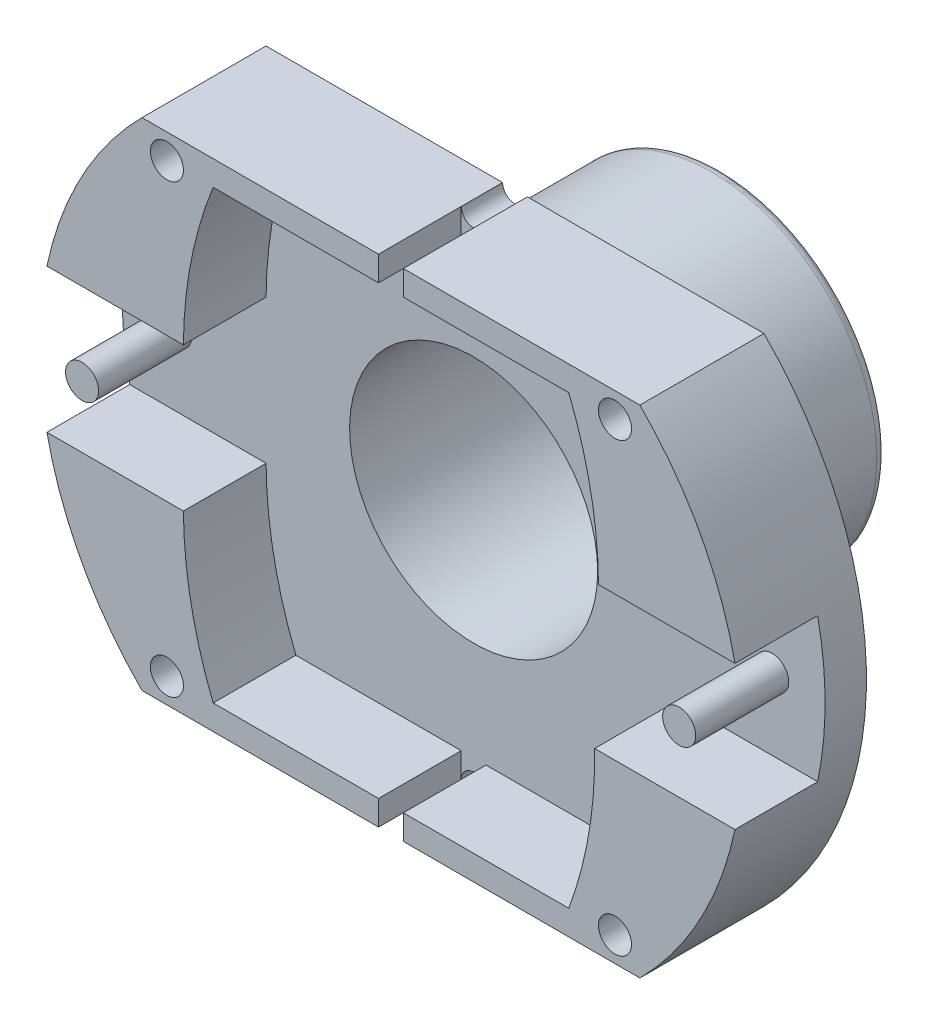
ISO-10303-21;
HEADER;
FILE_DESCRIPTION(('STEP AP214'),'2;1');
FILE_NAME('part.step','',(''),(''),'','','');
FILE_SCHEMA(('AUTOMOTIVE_DESIGN { 1 0 10303 214 1 1 1 1 }'));
ENDSEC;
DATA;
#1=APPLICATION_CONTEXT('core data for automotive mechanical design processes');
#2=APPLICATION_PROTOCOL_DEFINITION('international standard','automotive_design',2000,#1);
#3=PRODUCT_CONTEXT('',#1,'mechanical');
#4=PRODUCT('Part','Part','',(#3));
#5=PRODUCT_RELATED_PRODUCT_CATEGORY('part','',(#4));
#6=PRODUCT_DEFINITION_FORMATION('','',#4);
#7=PRODUCT_DEFINITION_CONTEXT('part definition',#1,'design');
#8=PRODUCT_DEFINITION('design','',#6,#7);
#9=PRODUCT_DEFINITION_SHAPE('','',#8);
#10=(LENGTH_UNIT() NAMED_UNIT(*) SI_UNIT(.MILLI.,.METRE.));
#11=(NAMED_UNIT(*) PLANE_ANGLE_UNIT() SI_UNIT($,.RADIAN.));
#12=(NAMED_UNIT(*) SI_UNIT($,.STERADIAN.) SOLID_ANGLE_UNIT());
#13=UNCERTAINTY_MEASURE_WITH_UNIT(LENGTH_MEASURE(1.E-05),#10,'distance_accuracy_value','');
#14=(GEOMETRIC_REPRESENTATION_CONTEXT(3) GLOBAL_UNCERTAINTY_ASSIGNED_CONTEXT((#13)) GLOBAL_UNIT_ASSIGNED_CONTEXT((#10,
#11,#12)) REPRESENTATION_CONTEXT('',''));
#15=CARTESIAN_POINT('',(0.,0.,0.));
#16=DIRECTION('',(0.,0.,1.));
#17=DIRECTION('',(1.,0.,0.));
#18=AXIS2_PLACEMENT_3D('',#15,#16,#17);
#19=CARTESIAN_POINT('',(-52.9982936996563,31.8784246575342,0.));
#20=DIRECTION('',(0.,0.,1.));
#21=DIRECTION('',(1.,0.,0.));
#22=AXIS2_PLACEMENT_3D('',#19,#20,#21);
#23=PLANE('',#22);
#24=CARTESIAN_POINT('',(-52.9982936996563,31.8784246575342,0.));
#25=DIRECTION('',(0.,0.,1.));
#26=DIRECTION('',(1.,0.,0.));
#27=AXIS2_PLACEMENT_3D('',#24,#25,#26);
#28=CIRCLE('',#27,8.5);
#29=CARTESIAN_POINT('',(-46.9774964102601,25.8784246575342,0.));
#30=VERTEX_POINT('',#29);
#31=CARTESIAN_POINT('',(-46.9774964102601,37.8784246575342,0.));
#32=VERTEX_POINT('',#31);
#33=EDGE_CURVE('E448',#30,#32,#28,.T.);
#34=ORIENTED_EDGE('',*,*,#33,.F.);
#35=DIRECTION('',(1.,0.,0.));
#36=VECTOR('',#35,1.);
#37=CARTESIAN_POINT('',(-52.6982936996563,25.8784246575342,0.));
#38=LINE('',#37,#36);
#39=CARTESIAN_POINT('',(-52.6982936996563,25.8784246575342,0.));
#40=VERTEX_POINT('',#39);
#41=EDGE_CURVE('E452',#40,#30,#38,.T.);
#42=ORIENTED_EDGE('',*,*,#41,.F.);
#43=CARTESIAN_POINT('',(-52.9982936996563,25.8784246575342,0.));
#44=DIRECTION('',(0.,0.,-1.));
#45=DIRECTION('',(1.,0.,0.));
#46=AXIS2_PLACEMENT_3D('',#43,#44,#45);
#47=CIRCLE('',#46,0.300000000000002);
#48=CARTESIAN_POINT('',(-53.2982936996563,25.8784246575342,0.));
#49=VERTEX_POINT('',#48);
#50=EDGE_CURVE('E609',#49,#40,#47,.T.);
#51=ORIENTED_EDGE('',*,*,#50,.F.);
#52=DIRECTION('',(1.,0.,0.));
#53=VECTOR('',#52,1.);
#54=CARTESIAN_POINT('',(-59.0190909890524,25.8784246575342,0.));
#55=LINE('',#54,#53);
#56=CARTESIAN_POINT('',(-59.0190909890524,25.8784246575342,0.));
#57=VERTEX_POINT('',#56);
#58=EDGE_CURVE('E607',#57,#49,#55,.T.);
#59=ORIENTED_EDGE('',*,*,#58,.F.);
#60=CARTESIAN_POINT('',(-52.9982936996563,31.8784246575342,0.));
#61=DIRECTION('',(0.,0.,1.));
#62=DIRECTION('',(1.,0.,0.));
#63=AXIS2_PLACEMENT_3D('',#60,#61,#62);
#64=CIRCLE('',#63,8.5);
#65=CARTESIAN_POINT('',(-59.0190909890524,37.8784246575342,0.));
#66=VERTEX_POINT('',#65);
#67=EDGE_CURVE('E605',#66,#57,#64,.T.);
#68=ORIENTED_EDGE('',*,*,#67,.F.);
#69=DIRECTION('',(-1.,0.,0.));
#70=VECTOR('',#69,1.);
#71=CARTESIAN_POINT('',(-59.0190909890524,37.8784246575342,0.));
#72=LINE('',#71,#70);
#73=CARTESIAN_POINT('',(-53.2982936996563,37.8784246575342,0.));
#74=VERTEX_POINT('',#73);
#75=EDGE_CURVE('E603',#74,#66,#72,.T.);
#76=ORIENTED_EDGE('',*,*,#75,.F.);
#77=CARTESIAN_POINT('',(-52.9982936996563,37.8784246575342,0.));
#78=DIRECTION('',(0.,0.,-1.));
#79=DIRECTION('',(1.,0.,0.));
#80=AXIS2_PLACEMENT_3D('',#77,#78,#79);
#81=CIRCLE('',#80,0.300000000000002);
#82=CARTESIAN_POINT('',(-52.6982936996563,37.8784246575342,0.));
#83=VERTEX_POINT('',#82);
#84=EDGE_CURVE('E599',#83,#74,#81,.T.);
#85=ORIENTED_EDGE('',*,*,#84,.F.);
#86=DIRECTION('',(-1.,0.,0.));
#87=VECTOR('',#86,1.);
#88=CARTESIAN_POINT('',(-52.6982936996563,37.8784246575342,0.));
#89=LINE('',#88,#87);
#90=EDGE_CURVE('E598',#32,#83,#89,.T.);
#91=ORIENTED_EDGE('',*,*,#90,.F.);
#92=EDGE_LOOP('',(#34,#42,#51,#59,#68,#76,#85,#91));
#93=FACE_BOUND('',#92,.T.);
#94=CARTESIAN_POINT('',(-52.9982936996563,31.8784246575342,0.));
#95=DIRECTION('',(0.,0.,1.));
#96=DIRECTION('',(1.,0.,0.));
#97=AXIS2_PLACEMENT_3D('',#94,#95,#96);
#98=CIRCLE('',#97,4.00000000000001);
#99=CARTESIAN_POINT('',(-48.9982936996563,31.8784246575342,0.));
#100=VERTEX_POINT('',#99);
#101=EDGE_CURVE('E481',#100,#100,#98,.F.);
#102=ORIENTED_EDGE('',*,*,#101,.F.);
#103=EDGE_LOOP('',(#102));
#104=FACE_BOUND('',#103,.T.);
#105=ADVANCED_FACE('F37',(#93,#104),#23,.F.);
#106=CARTESIAN_POINT('',(-52.9982936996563,31.8784246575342,1.));
#107=DIRECTION('',(0.,0.,1.));
#108=DIRECTION('',(1.,0.,0.));
#109=AXIS2_PLACEMENT_3D('',#106,#107,#108);
#110=PLANE('',#109);
#111=CARTESIAN_POINT('',(-52.9982936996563,31.8784246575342,1.));
#112=DIRECTION('',(0.,0.,1.));
#113=DIRECTION('',(1.,0.,0.));
#114=AXIS2_PLACEMENT_3D('',#111,#112,#113);
#115=CIRCLE('',#114,3.);
#116=CARTESIAN_POINT('',(-49.9982936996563,31.8784246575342,1.));
#117=VERTEX_POINT('',#116);
#118=EDGE_CURVE('E445',#117,#117,#115,.T.);
#119=ORIENTED_EDGE('',*,*,#118,.F.);
#120=EDGE_LOOP('',(#119));
#121=FACE_BOUND('',#120,.T.);
#122=CARTESIAN_POINT('',(-45.7774964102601,31.8784246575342,1.));
#123=DIRECTION('',(0.,0.,1.));
#124=DIRECTION('',(1.,0.,0.));
#125=AXIS2_PLACEMENT_3D('',#122,#123,#124);
#126=CIRCLE('',#125,0.399999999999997);
#127=CARTESIAN_POINT('',(-45.3774964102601,31.8784246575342,1.));
#128=VERTEX_POINT('',#127);
#129=EDGE_CURVE('E269',#128,#128,#126,.T.);
#130=ORIENTED_EDGE('',*,*,#129,.F.);
#131=EDGE_LOOP('',(#130));
#132=FACE_BOUND('',#131,.T.);
#133=CARTESIAN_POINT('',(-58.0704214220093,29.9660057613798,1.));
#134=DIRECTION('',(0.,0.,-1.));
#135=DIRECTION('',(1.,0.,0.));
#136=AXIS2_PLACEMENT_3D('',#133,#134,#135);
#137=CIRCLE('',#136,10.);
#138=CARTESIAN_POINT('',(-48.0719079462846,30.1384246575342,1.));
#139=VERTEX_POINT('',#138);
#140=CARTESIAN_POINT('',(-48.6982936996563,26.4784246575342,1.));
#141=VERTEX_POINT('',#140);
#142=EDGE_CURVE('E294',#139,#141,#137,.T.);
#143=ORIENTED_EDGE('',*,*,#142,.F.);
#144=DIRECTION('',(-1.,0.,0.));
#145=VECTOR('',#144,1.);
#146=CARTESIAN_POINT('',(-44.6782936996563,30.1384246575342,1.));
#147=LINE('',#146,#145);
#148=CARTESIAN_POINT('',(-44.6782936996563,30.1384246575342,1.));
#149=VERTEX_POINT('',#148);
#150=EDGE_CURVE('E275',#149,#139,#147,.T.);
#151=ORIENTED_EDGE('',*,*,#150,.F.);
#152=CARTESIAN_POINT('',(-52.9982936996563,31.8784246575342,1.));
#153=DIRECTION('',(0.,0.,1.));
#154=DIRECTION('',(1.,0.,0.));
#155=AXIS2_PLACEMENT_3D('',#152,#153,#154);
#156=CIRCLE('',#155,8.5);
#157=CARTESIAN_POINT('',(-44.6782936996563,33.6184246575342,1.));
#158=VERTEX_POINT('',#157);
#159=EDGE_CURVE('E449',#149,#158,#156,.T.);
#160=ORIENTED_EDGE('',*,*,#159,.T.);
#161=DIRECTION('',(1.,0.,0.));
#162=VECTOR('',#161,1.);
#163=CARTESIAN_POINT('',(-44.6782936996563,33.6184246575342,1.));
#164=LINE('',#163,#162);
#165=CARTESIAN_POINT('',(-47.9782936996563,33.6184246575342,1.));
#166=VERTEX_POINT('',#165);
#167=EDGE_CURVE('E324',#166,#158,#164,.T.);
#168=ORIENTED_EDGE('',*,*,#167,.F.);
#169=CARTESIAN_POINT('',(-57.9780735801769,33.5520745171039,1.));
#170=DIRECTION('',(0.,0.,-1.));
#171=DIRECTION('',(-1.,0.,0.));
#172=AXIS2_PLACEMENT_3D('',#169,#170,#171);
#173=CIRCLE('',#172,10.);
#174=CARTESIAN_POINT('',(-48.6982936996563,37.2784246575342,1.));
#175=VERTEX_POINT('',#174);
#176=EDGE_CURVE('E340',#175,#166,#173,.T.);
#177=ORIENTED_EDGE('',*,*,#176,.F.);
#178=DIRECTION('',(1.,0.,0.));
#179=VECTOR('',#178,1.);
#180=CARTESIAN_POINT('',(-52.6982936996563,37.2784246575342,1.));
#181=LINE('',#180,#179);
#182=CARTESIAN_POINT('',(-52.6982936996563,37.2784246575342,1.));
#183=VERTEX_POINT('',#182);
#184=EDGE_CURVE('E337',#183,#175,#181,.T.);
#185=ORIENTED_EDGE('',*,*,#184,.F.);
#186=DIRECTION('',(0.,-1.,0.));
#187=VECTOR('',#186,1.);
#188=CARTESIAN_POINT('',(-52.6982936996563,37.8784246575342,1.));
#189=LINE('',#188,#187);
#190=CARTESIAN_POINT('',(-52.6982936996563,37.8784246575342,1.));
#191=VERTEX_POINT('',#190);
#192=EDGE_CURVE('E319',#191,#183,#189,.T.);
#193=ORIENTED_EDGE('',*,*,#192,.F.);
#194=CARTESIAN_POINT('',(-52.9982936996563,37.8784246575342,1.));
#195=DIRECTION('',(0.,0.,-1.));
#196=DIRECTION('',(1.,0.,0.));
#197=AXIS2_PLACEMENT_3D('',#194,#195,#196);
#198=CIRCLE('',#197,0.300000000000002);
#199=CARTESIAN_POINT('',(-53.2982936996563,37.8784246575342,1.));
#200=VERTEX_POINT('',#199);
#201=EDGE_CURVE('E451',#191,#200,#198,.T.);
#202=ORIENTED_EDGE('',*,*,#201,.T.);
#203=DIRECTION('',(0.,1.,0.));
#204=VECTOR('',#203,1.);
#205=CARTESIAN_POINT('',(-53.2982936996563,37.8784246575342,1.));
#206=LINE('',#205,#204);
#207=CARTESIAN_POINT('',(-53.2982936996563,37.2784246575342,1.));
#208=VERTEX_POINT('',#207);
#209=EDGE_CURVE('E413',#208,#200,#206,.T.);
#210=ORIENTED_EDGE('',*,*,#209,.F.);
#211=DIRECTION('',(1.,0.,0.));
#212=VECTOR('',#211,1.);
#213=CARTESIAN_POINT('',(-53.2982936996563,37.2784246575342,1.));
#214=LINE('',#213,#212);
#215=CARTESIAN_POINT('',(-57.2982936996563,37.2784246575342,1.));
#216=VERTEX_POINT('',#215);
#217=EDGE_CURVE('E428',#216,#208,#214,.T.);
#218=ORIENTED_EDGE('',*,*,#217,.F.);
#219=CARTESIAN_POINT('',(-48.0185138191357,33.552074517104,1.));
#220=DIRECTION('',(0.,0.,-1.));
#221=DIRECTION('',(-1.,0.,0.));
#222=AXIS2_PLACEMENT_3D('',#219,#220,#221);
#223=CIRCLE('',#222,9.99999999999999);
#224=CARTESIAN_POINT('',(-58.0182936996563,33.6184246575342,1.));
#225=VERTEX_POINT('',#224);
#226=EDGE_CURVE('E425',#225,#216,#223,.T.);
#227=ORIENTED_EDGE('',*,*,#226,.F.);
#228=DIRECTION('',(1.,0.,0.));
#229=VECTOR('',#228,1.);
#230=CARTESIAN_POINT('',(-61.3182936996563,33.6184246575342,1.));
#231=LINE('',#230,#229);
#232=CARTESIAN_POINT('',(-61.3182936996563,33.6184246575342,1.));
#233=VERTEX_POINT('',#232);
#234=EDGE_CURVE('E406',#233,#225,#231,.T.);
#235=ORIENTED_EDGE('',*,*,#234,.F.);
#236=CARTESIAN_POINT('',(-52.9982936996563,31.8784246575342,1.));
#237=DIRECTION('',(0.,0.,1.));
#238=DIRECTION('',(1.,0.,0.));
#239=AXIS2_PLACEMENT_3D('',#236,#237,#238);
#240=CIRCLE('',#239,8.5);
#241=CARTESIAN_POINT('',(-61.3182936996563,30.1384246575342,1.));
#242=VERTEX_POINT('',#241);
#243=EDGE_CURVE('E454',#233,#242,#240,.T.);
#244=ORIENTED_EDGE('',*,*,#243,.T.);
#245=DIRECTION('',(-1.,0.,0.));
#246=VECTOR('',#245,1.);
#247=CARTESIAN_POINT('',(-61.3182936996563,30.1384246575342,1.));
#248=LINE('',#247,#246);
#249=CARTESIAN_POINT('',(-58.0182936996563,30.1384246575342,1.));
#250=VERTEX_POINT('',#249);
#251=EDGE_CURVE('E367',#250,#242,#248,.T.);
#252=ORIENTED_EDGE('',*,*,#251,.F.);
#253=CARTESIAN_POINT('',(-48.0185138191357,30.2047747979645,1.));
#254=DIRECTION('',(0.,0.,-1.));
#255=DIRECTION('',(1.,0.,0.));
#256=AXIS2_PLACEMENT_3D('',#253,#254,#255);
#257=CIRCLE('',#256,9.99999999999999);
#258=CARTESIAN_POINT('',(-57.2982936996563,26.4784246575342,1.));
#259=VERTEX_POINT('',#258);
#260=EDGE_CURVE('E383',#259,#250,#257,.T.);
#261=ORIENTED_EDGE('',*,*,#260,.F.);
#262=DIRECTION('',(-1.,0.,0.));
#263=VECTOR('',#262,1.);
#264=CARTESIAN_POINT('',(-53.2982936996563,26.4784246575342,1.));
#265=LINE('',#264,#263);
#266=CARTESIAN_POINT('',(-53.2982936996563,26.4784246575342,1.));
#267=VERTEX_POINT('',#266);
#268=EDGE_CURVE('E380',#267,#259,#265,.T.);
#269=ORIENTED_EDGE('',*,*,#268,.F.);
#270=DIRECTION('',(0.,1.,0.));
#271=VECTOR('',#270,1.);
#272=CARTESIAN_POINT('',(-53.2982936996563,25.8784246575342,1.));
#273=LINE('',#272,#271);
#274=CARTESIAN_POINT('',(-53.2982936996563,25.8784246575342,1.));
#275=VERTEX_POINT('',#274);
#276=EDGE_CURVE('E362',#275,#267,#273,.T.);
#277=ORIENTED_EDGE('',*,*,#276,.F.);
#278=CARTESIAN_POINT('',(-52.9982936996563,25.8784246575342,1.));
#279=DIRECTION('',(0.,0.,-1.));
#280=DIRECTION('',(1.,0.,0.));
#281=AXIS2_PLACEMENT_3D('',#278,#279,#280);
#282=CIRCLE('',#281,0.300000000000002);
#283=CARTESIAN_POINT('',(-52.6982936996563,25.8784246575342,1.));
#284=VERTEX_POINT('',#283);
#285=EDGE_CURVE('E457',#275,#284,#282,.T.);
#286=ORIENTED_EDGE('',*,*,#285,.T.);
#287=DIRECTION('',(0.,-1.,0.));
#288=VECTOR('',#287,1.);
#289=CARTESIAN_POINT('',(-52.6982936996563,25.8784246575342,1.));
#290=LINE('',#289,#288);
#291=CARTESIAN_POINT('',(-52.6982936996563,26.4784246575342,1.));
#292=VERTEX_POINT('',#291);
#293=EDGE_CURVE('E280',#292,#284,#290,.T.);
#294=ORIENTED_EDGE('',*,*,#293,.F.);
#295=DIRECTION('',(-1.,0.,0.));
#296=VECTOR('',#295,1.);
#297=CARTESIAN_POINT('',(-52.6982936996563,26.4784246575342,1.));
#298=LINE('',#297,#296);
#299=EDGE_CURVE('E297',#141,#292,#298,.T.);
#300=ORIENTED_EDGE('',*,*,#299,.F.);
#301=EDGE_LOOP('',(#143,#151,#160,#168,#177,#185,#193,#202,#210,#218,#227,#235,#244,#252,#261,
#269,#277,#286,#294,#300));
#302=FACE_BOUND('',#301,.T.);
#303=CARTESIAN_POINT('',(-60.2190909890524,31.8784246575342,1.));
#304=DIRECTION('',(0.,0.,1.));
#305=DIRECTION('',(1.,0.,0.));
#306=AXIS2_PLACEMENT_3D('',#303,#304,#305);
#307=CIRCLE('',#306,0.399999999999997);
#308=CARTESIAN_POINT('',(-59.8190909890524,31.8784246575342,1.));
#309=VERTEX_POINT('',#308);
#310=EDGE_CURVE('E266',#309,#309,#307,.T.);
#311=ORIENTED_EDGE('',*,*,#310,.F.);
#312=EDGE_LOOP('',(#311));
#313=FACE_BOUND('',#312,.T.);
#314=ADVANCED_FACE('F544',(#121,#132,#302,#313),#110,.T.);
#315=CARTESIAN_POINT('',(-52.9982936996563,31.8784246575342,1.));
#316=DIRECTION('',(0.,0.,-1.));
#317=DIRECTION('',(-1.,0.,0.));
#318=AXIS2_PLACEMENT_3D('',#315,#316,#317);
#319=CYLINDRICAL_SURFACE('',#318,8.5);
#320=ORIENTED_EDGE('',*,*,#33,.T.);
#321=DIRECTION('',(0.,0.,-1.));
#322=VECTOR('',#321,1.);
#323=CARTESIAN_POINT('',(-46.9774964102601,37.8784246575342,1.));
#324=LINE('',#323,#322);
#325=CARTESIAN_POINT('',(-46.9774964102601,37.8784246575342,3.));
#326=VERTEX_POINT('',#325);
#327=EDGE_CURVE('E462',#326,#32,#324,.T.);
#328=ORIENTED_EDGE('',*,*,#327,.F.);
#329=CARTESIAN_POINT('',(-52.9982936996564,31.8784246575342,3.));
#330=DIRECTION('',(0.,0.,1.));
#331=DIRECTION('',(-1.,0.,0.));
#332=AXIS2_PLACEMENT_3D('',#329,#330,#331);
#333=CIRCLE('',#332,8.5000000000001);
#334=CARTESIAN_POINT('',(-44.6782936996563,33.6184246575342,3.));
#335=VERTEX_POINT('',#334);
#336=EDGE_CURVE('E320',#335,#326,#333,.T.);
#337=ORIENTED_EDGE('',*,*,#336,.F.);
#338=DIRECTION('',(0.,0.,-1.));
#339=VECTOR('',#338,1.);
#340=CARTESIAN_POINT('',(-44.6782936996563,33.6184246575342,3.));
#341=LINE('',#340,#339);
#342=EDGE_CURVE('E334',#335,#158,#341,.T.);
#343=ORIENTED_EDGE('',*,*,#342,.T.);
#344=ORIENTED_EDGE('',*,*,#159,.F.);
#345=DIRECTION('',(0.,0.,-1.));
#346=VECTOR('',#345,1.);
#347=CARTESIAN_POINT('',(-44.6782936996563,30.1384246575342,3.));
#348=LINE('',#347,#346);
#349=CARTESIAN_POINT('',(-44.6782936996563,30.1384246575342,3.));
#350=VERTEX_POINT('',#349);
#351=EDGE_CURVE('E313',#350,#149,#348,.T.);
#352=ORIENTED_EDGE('',*,*,#351,.F.);
#353=CARTESIAN_POINT('',(-52.9982936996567,31.8784246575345,3.));
#354=DIRECTION('',(0.,0.,1.));
#355=DIRECTION('',(1.,0.,0.));
#356=AXIS2_PLACEMENT_3D('',#353,#354,#355);
#357=CIRCLE('',#356,8.50000000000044);
#358=CARTESIAN_POINT('',(-46.9774964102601,25.8784246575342,3.));
#359=VERTEX_POINT('',#358);
#360=EDGE_CURVE('E276',#359,#350,#357,.T.);
#361=ORIENTED_EDGE('',*,*,#360,.F.);
#362=DIRECTION('',(0.,0.,-1.));
#363=VECTOR('',#362,1.);
#364=CARTESIAN_POINT('',(-46.9774964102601,25.8784246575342,1.));
#365=LINE('',#364,#363);
#366=EDGE_CURVE('E596',#359,#30,#365,.T.);
#367=ORIENTED_EDGE('',*,*,#366,.T.);
#368=EDGE_LOOP('',(#320,#328,#337,#343,#344,#352,#361,#367));
#369=FACE_BOUND('',#368,.T.);
#370=ADVANCED_FACE('F550',(#369),#319,.T.);
#371=CARTESIAN_POINT('',(-52.6982936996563,37.8784246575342,1.));
#372=DIRECTION('',(0.,-1.,0.));
#373=DIRECTION('',(0.,0.,-1.));
#374=AXIS2_PLACEMENT_3D('',#371,#372,#373);
#375=PLANE('',#374);
#376=ORIENTED_EDGE('',*,*,#90,.T.);
#377=DIRECTION('',(0.,0.,-1.));
#378=VECTOR('',#377,1.);
#379=CARTESIAN_POINT('',(-52.6982936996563,37.8784246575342,1.));
#380=LINE('',#379,#378);
#381=EDGE_CURVE('E627',#191,#83,#380,.T.);
#382=ORIENTED_EDGE('',*,*,#381,.F.);
#383=DIRECTION('',(0.,0.,-1.));
#384=VECTOR('',#383,1.);
#385=CARTESIAN_POINT('',(-52.6982936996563,37.8784246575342,3.));
#386=LINE('',#385,#384);
#387=CARTESIAN_POINT('',(-52.6982936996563,37.8784246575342,3.));
#388=VERTEX_POINT('',#387);
#389=EDGE_CURVE('E356',#388,#191,#386,.T.);
#390=ORIENTED_EDGE('',*,*,#389,.F.);
#391=DIRECTION('',(-1.,0.,0.));
#392=VECTOR('',#391,1.);
#393=CARTESIAN_POINT('',(-52.6982936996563,37.8784246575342,3.));
#394=LINE('',#393,#392);
#395=EDGE_CURVE('E323',#326,#388,#394,.T.);
#396=ORIENTED_EDGE('',*,*,#395,.F.);
#397=ORIENTED_EDGE('',*,*,#327,.T.);
#398=EDGE_LOOP('',(#376,#382,#390,#396,#397));
#399=FACE_BOUND('',#398,.T.);
#400=ADVANCED_FACE('F582',(#399),#375,.F.);
#401=CARTESIAN_POINT('',(-52.9982936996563,37.8784246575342,1.));
#402=DIRECTION('',(0.,0.,-1.));
#403=DIRECTION('',(-1.,0.,0.));
#404=AXIS2_PLACEMENT_3D('',#401,#402,#403);
#405=CYLINDRICAL_SURFACE('',#404,0.300000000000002);
#406=ORIENTED_EDGE('',*,*,#84,.T.);
#407=DIRECTION('',(0.,0.,-1.));
#408=VECTOR('',#407,1.);
#409=CARTESIAN_POINT('',(-53.2982936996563,37.8784246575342,1.));
#410=LINE('',#409,#408);
#411=EDGE_CURVE('E625',#200,#74,#410,.T.);
#412=ORIENTED_EDGE('',*,*,#411,.F.);
#413=ORIENTED_EDGE('',*,*,#201,.F.);
#414=ORIENTED_EDGE('',*,*,#381,.T.);
#415=EDGE_LOOP('',(#406,#412,#413,#414));
#416=FACE_BOUND('',#415,.T.);
#417=ADVANCED_FACE('F578',(#416),#405,.F.);
#418=CARTESIAN_POINT('',(-59.0190909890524,37.8784246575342,1.));
#419=DIRECTION('',(0.,-1.,0.));
#420=DIRECTION('',(0.,0.,-1.));
#421=AXIS2_PLACEMENT_3D('',#418,#419,#420);
#422=PLANE('',#421);
#423=ORIENTED_EDGE('',*,*,#75,.T.);
#424=DIRECTION('',(0.,0.,-1.));
#425=VECTOR('',#424,1.);
#426=CARTESIAN_POINT('',(-59.0190909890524,37.8784246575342,1.));
#427=LINE('',#426,#425);
#428=CARTESIAN_POINT('',(-59.0190909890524,37.8784246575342,3.));
#429=VERTEX_POINT('',#428);
#430=EDGE_CURVE('E622',#429,#66,#427,.T.);
#431=ORIENTED_EDGE('',*,*,#430,.F.);
#432=DIRECTION('',(-1.,0.,0.));
#433=VECTOR('',#432,1.);
#434=CARTESIAN_POINT('',(-53.2982936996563,37.8784246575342,3.));
#435=LINE('',#434,#433);
#436=CARTESIAN_POINT('',(-53.2982936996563,37.8784246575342,3.));
#437=VERTEX_POINT('',#436);
#438=EDGE_CURVE('E421',#437,#429,#435,.T.);
#439=ORIENTED_EDGE('',*,*,#438,.F.);
#440=DIRECTION('',(0.,0.,-1.));
#441=VECTOR('',#440,1.);
#442=CARTESIAN_POINT('',(-53.2982936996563,37.8784246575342,3.));
#443=LINE('',#442,#441);
#444=EDGE_CURVE('E424',#437,#200,#443,.T.);
#445=ORIENTED_EDGE('',*,*,#444,.T.);
#446=ORIENTED_EDGE('',*,*,#411,.T.);
#447=EDGE_LOOP('',(#423,#431,#439,#445,#446));
#448=FACE_BOUND('',#447,.T.);
#449=ADVANCED_FACE('F574',(#448),#422,.F.);
#450=CARTESIAN_POINT('',(-52.9982936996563,31.8784246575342,1.));
#451=DIRECTION('',(0.,0.,-1.));
#452=DIRECTION('',(-1.,0.,0.));
#453=AXIS2_PLACEMENT_3D('',#450,#451,#452);
#454=CYLINDRICAL_SURFACE('',#453,8.5);
#455=ORIENTED_EDGE('',*,*,#67,.T.);
#456=DIRECTION('',(0.,0.,-1.));
#457=VECTOR('',#456,1.);
#458=CARTESIAN_POINT('',(-59.0190909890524,25.8784246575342,1.));
#459=LINE('',#458,#457);
#460=CARTESIAN_POINT('',(-59.0190909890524,25.8784246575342,3.));
#461=VERTEX_POINT('',#460);
#462=EDGE_CURVE('E619',#461,#57,#459,.T.);
#463=ORIENTED_EDGE('',*,*,#462,.F.);
#464=CARTESIAN_POINT('',(-52.9982936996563,31.8784246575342,3.));
#465=DIRECTION('',(0.,0.,1.));
#466=DIRECTION('',(-1.,0.,0.));
#467=AXIS2_PLACEMENT_3D('',#464,#465,#466);
#468=CIRCLE('',#467,8.5);
#469=CARTESIAN_POINT('',(-61.3182936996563,30.1384246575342,3.));
#470=VERTEX_POINT('',#469);
#471=EDGE_CURVE('E363',#470,#461,#468,.T.);
#472=ORIENTED_EDGE('',*,*,#471,.F.);
#473=DIRECTION('',(0.,0.,-1.));
#474=VECTOR('',#473,1.);
#475=CARTESIAN_POINT('',(-61.3182936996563,30.1384246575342,3.));
#476=LINE('',#475,#474);
#477=EDGE_CURVE('E377',#470,#242,#476,.T.);
#478=ORIENTED_EDGE('',*,*,#477,.T.);
#479=ORIENTED_EDGE('',*,*,#243,.F.);
#480=DIRECTION('',(0.,0.,-1.));
#481=VECTOR('',#480,1.);
#482=CARTESIAN_POINT('',(-61.3182936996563,33.6184246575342,3.));
#483=LINE('',#482,#481);
#484=CARTESIAN_POINT('',(-61.3182936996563,33.6184246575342,3.));
#485=VERTEX_POINT('',#484);
#486=EDGE_CURVE('E444',#485,#233,#483,.T.);
#487=ORIENTED_EDGE('',*,*,#486,.F.);
#488=CARTESIAN_POINT('',(-52.9982936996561,31.8784246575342,3.));
#489=DIRECTION('',(0.,0.,1.));
#490=DIRECTION('',(-1.,0.,0.));
#491=AXIS2_PLACEMENT_3D('',#488,#489,#490);
#492=CIRCLE('',#491,8.50000000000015);
#493=EDGE_CURVE('E409',#429,#485,#492,.T.);
#494=ORIENTED_EDGE('',*,*,#493,.F.);
#495=ORIENTED_EDGE('',*,*,#430,.T.);
#496=EDGE_LOOP('',(#455,#463,#472,#478,#479,#487,#494,#495));
#497=FACE_BOUND('',#496,.T.);
#498=ADVANCED_FACE('F570',(#497),#454,.T.);
#499=CARTESIAN_POINT('',(-59.0190909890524,25.8784246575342,1.));
#500=DIRECTION('',(0.,1.,0.));
#501=DIRECTION('',(0.,0.,1.));
#502=AXIS2_PLACEMENT_3D('',#499,#500,#501);
#503=PLANE('',#502);
#504=ORIENTED_EDGE('',*,*,#58,.T.);
#505=DIRECTION('',(0.,0.,-1.));
#506=VECTOR('',#505,1.);
#507=CARTESIAN_POINT('',(-53.2982936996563,25.8784246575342,1.));
#508=LINE('',#507,#506);
#509=EDGE_CURVE('E616',#275,#49,#508,.T.);
#510=ORIENTED_EDGE('',*,*,#509,.F.);
#511=DIRECTION('',(0.,0.,-1.));
#512=VECTOR('',#511,1.);
#513=CARTESIAN_POINT('',(-53.2982936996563,25.8784246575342,3.));
#514=LINE('',#513,#512);
#515=CARTESIAN_POINT('',(-53.2982936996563,25.8784246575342,3.));
#516=VERTEX_POINT('',#515);
#517=EDGE_CURVE('E399',#516,#275,#514,.T.);
#518=ORIENTED_EDGE('',*,*,#517,.F.);
#519=DIRECTION('',(1.,0.,0.));
#520=VECTOR('',#519,1.);
#521=CARTESIAN_POINT('',(-53.2982936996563,25.8784246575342,3.));
#522=LINE('',#521,#520);
#523=EDGE_CURVE('E366',#461,#516,#522,.T.);
#524=ORIENTED_EDGE('',*,*,#523,.F.);
#525=ORIENTED_EDGE('',*,*,#462,.T.);
#526=EDGE_LOOP('',(#504,#510,#518,#524,#525));
#527=FACE_BOUND('',#526,.T.);
#528=ADVANCED_FACE('F566',(#527),#503,.F.);
#529=CARTESIAN_POINT('',(-52.9982936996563,25.8784246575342,1.));
#530=DIRECTION('',(0.,0.,-1.));
#531=DIRECTION('',(-1.,0.,0.));
#532=AXIS2_PLACEMENT_3D('',#529,#530,#531);
#533=CYLINDRICAL_SURFACE('',#532,0.300000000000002);
#534=ORIENTED_EDGE('',*,*,#50,.T.);
#535=DIRECTION('',(0.,0.,-1.));
#536=VECTOR('',#535,1.);
#537=CARTESIAN_POINT('',(-52.6982936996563,25.8784246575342,1.));
#538=LINE('',#537,#536);
#539=EDGE_CURVE('E613',#284,#40,#538,.T.);
#540=ORIENTED_EDGE('',*,*,#539,.F.);
#541=ORIENTED_EDGE('',*,*,#285,.F.);
#542=ORIENTED_EDGE('',*,*,#509,.T.);
#543=EDGE_LOOP('',(#534,#540,#541,#542));
#544=FACE_BOUND('',#543,.T.);
#545=ADVANCED_FACE('F562',(#544),#533,.F.);
#546=CARTESIAN_POINT('',(-52.6982936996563,25.8784246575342,1.));
#547=DIRECTION('',(0.,1.,0.));
#548=DIRECTION('',(0.,0.,1.));
#549=AXIS2_PLACEMENT_3D('',#546,#547,#548);
#550=PLANE('',#549);
#551=ORIENTED_EDGE('',*,*,#41,.T.);
#552=ORIENTED_EDGE('',*,*,#366,.F.);
#553=DIRECTION('',(1.,0.,0.));
#554=VECTOR('',#553,1.);
#555=CARTESIAN_POINT('',(-52.6982936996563,25.8784246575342,3.));
#556=LINE('',#555,#554);
#557=CARTESIAN_POINT('',(-52.6982936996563,25.8784246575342,3.));
#558=VERTEX_POINT('',#557);
#559=EDGE_CURVE('E288',#558,#359,#556,.T.);
#560=ORIENTED_EDGE('',*,*,#559,.F.);
#561=DIRECTION('',(0.,0.,-1.));
#562=VECTOR('',#561,1.);
#563=CARTESIAN_POINT('',(-52.6982936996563,25.8784246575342,3.));
#564=LINE('',#563,#562);
#565=EDGE_CURVE('E291',#558,#284,#564,.T.);
#566=ORIENTED_EDGE('',*,*,#565,.T.);
#567=ORIENTED_EDGE('',*,*,#539,.T.);
#568=EDGE_LOOP('',(#551,#552,#560,#566,#567));
#569=FACE_BOUND('',#568,.T.);
#570=ADVANCED_FACE('F559',(#569),#550,.F.);
#571=CARTESIAN_POINT('',(-52.9982936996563,31.8784246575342,1.));
#572=DIRECTION('',(0.,0.,-1.));
#573=DIRECTION('',(-1.,0.,0.));
#574=AXIS2_PLACEMENT_3D('',#571,#572,#573);
#575=CYLINDRICAL_SURFACE('',#574,3.);
#576=DIRECTION('',(0.,0.,-1.));
#577=VECTOR('',#576,1.);
#578=CARTESIAN_POINT('',(-54.0243541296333,34.697502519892,2.21503069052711));
#579=LINE('',#578,#577);
#580=CARTESIAN_POINT('',(-54.0243541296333,34.697502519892,0.556149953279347));
#581=VERTEX_POINT('',#580);
#582=CARTESIAN_POINT('',(-54.0243541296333,34.697502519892,-5.));
#583=VERTEX_POINT('',#582);
#584=EDGE_CURVE('E239',#581,#583,#579,.T.);
#585=ORIENTED_EDGE('',*,*,#584,.F.);
#586=CARTESIAN_POINT('',(-50.4002174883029,33.3784246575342,-30.));
#587=CARTESIAN_POINT('',(-50.6158849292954,33.7519716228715,-29.4318181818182));
#588=CARTESIAN_POINT('',(-50.9280566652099,34.0496267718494,-28.8636363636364));
#589=CARTESIAN_POINT('',(-51.2402284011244,34.3472819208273,-28.2954545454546));
#590=CARTESIAN_POINT('',(-51.623614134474,34.544931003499,-27.7272727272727));
#591=CARTESIAN_POINT('',(-52.0069998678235,34.7425800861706,-27.1590909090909));
#592=CARTESIAN_POINT('',(-52.430539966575,34.8242107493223,-26.5909090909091));
#593=CARTESIAN_POINT('',(-52.8540800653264,34.905841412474,-26.0227272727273));
#594=CARTESIAN_POINT('',(-53.2834618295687,34.8648404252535,-25.4545454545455));
#595=CARTESIAN_POINT('',(-53.7128435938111,34.8238394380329,-24.8863636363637));
#596=CARTESIAN_POINT('',(-54.1132810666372,34.6635284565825,-24.3181818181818));
#597=CARTESIAN_POINT('',(-54.5137185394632,34.503217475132,-23.75));
#598=CARTESIAN_POINT('',(-54.852770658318,34.2365839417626,-23.1818181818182));
#599=CARTESIAN_POINT('',(-55.1918227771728,33.9699504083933,-22.6136363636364));
#600=CARTESIAN_POINT('',(-55.4420215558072,33.6185953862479,-22.0454545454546));
#601=CARTESIAN_POINT('',(-55.6922203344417,33.2672403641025,-21.4772727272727));
#602=CARTESIAN_POINT('',(-55.8332961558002,32.8596285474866,-20.9090909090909));
#603=CARTESIAN_POINT('',(-55.9743719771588,32.4520167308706,-20.3409090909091));
#604=CARTESIAN_POINT('',(-55.9948957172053,32.0211704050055,-19.7727272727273));
#605=CARTESIAN_POINT('',(-56.0154194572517,31.5903240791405,-19.2045454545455));
#606=CARTESIAN_POINT('',(-55.9137284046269,31.171147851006,-18.6363636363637));
#607=CARTESIAN_POINT('',(-55.8120373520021,30.7519716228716,-18.0681818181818));
#608=CARTESIAN_POINT('',(-55.5963699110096,30.3784246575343,-17.5));
#609=CARTESIAN_POINT('',(-55.3807024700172,30.004877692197,-16.9318181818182));
#610=CARTESIAN_POINT('',(-55.0685307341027,29.7072225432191,-16.3636363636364));
#611=CARTESIAN_POINT('',(-54.7563589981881,29.4095673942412,-15.7954545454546));
#612=CARTESIAN_POINT('',(-54.3729732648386,29.2119183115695,-15.2272727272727));
#613=CARTESIAN_POINT('',(-53.989587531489,29.0142692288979,-14.6590909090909));
#614=CARTESIAN_POINT('',(-53.5660474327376,28.9326385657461,-14.0909090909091));
#615=CARTESIAN_POINT('',(-53.1425073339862,28.8510079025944,-13.5227272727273));
#616=CARTESIAN_POINT('',(-52.7131255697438,28.892008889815,-12.9545454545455));
#617=CARTESIAN_POINT('',(-52.2837438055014,28.9330098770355,-12.3863636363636));
#618=CARTESIAN_POINT('',(-51.8833063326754,29.093320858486,-11.8181818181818));
#619=CARTESIAN_POINT('',(-51.4828688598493,29.2536318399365,-11.25));
#620=CARTESIAN_POINT('',(-51.1438167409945,29.5202653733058,-10.6818181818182));
#621=CARTESIAN_POINT('',(-50.8047646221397,29.7868989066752,-10.1136363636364));
#622=CARTESIAN_POINT('',(-50.5545658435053,30.1382539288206,-9.54545454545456));
#623=CARTESIAN_POINT('',(-50.3043670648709,30.489608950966,-8.97727272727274));
#624=CARTESIAN_POINT('',(-50.1632912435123,30.8972207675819,-8.40909090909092));
#625=CARTESIAN_POINT('',(-50.0222154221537,31.3048325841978,-7.8409090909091));
#626=CARTESIAN_POINT('',(-50.0016916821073,31.7356789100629,-7.27272727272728));
#627=CARTESIAN_POINT('',(-49.9811679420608,32.166525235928,-6.70454545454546));
#628=CARTESIAN_POINT('',(-50.0828589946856,32.5857014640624,-6.13636363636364));
#629=CARTESIAN_POINT('',(-50.1845500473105,33.0048776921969,-5.56818181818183));
#630=CARTESIAN_POINT('',(-50.4002174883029,33.3784246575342,-5.00000000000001));
#631=CARTESIAN_POINT('',(-50.6158849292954,33.7519716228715,-4.43181818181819));
#632=CARTESIAN_POINT('',(-50.9280566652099,34.0496267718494,-3.86363636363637));
#633=CARTESIAN_POINT('',(-51.2402284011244,34.3472819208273,-3.29545454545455));
#634=CARTESIAN_POINT('',(-51.623614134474,34.544931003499,-2.72727272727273));
#635=CARTESIAN_POINT('',(-52.0069998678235,34.7425800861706,-2.15909090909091));
#636=CARTESIAN_POINT('',(-52.430539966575,34.8242107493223,-1.5909090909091));
#637=CARTESIAN_POINT('',(-52.8540800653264,34.905841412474,-1.02272727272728));
#638=CARTESIAN_POINT('',(-53.2834618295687,34.8648404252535,-0.454545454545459));
#639=CARTESIAN_POINT('',(-53.7128435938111,34.8238394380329,0.113636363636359));
#640=CARTESIAN_POINT('',(-54.1132810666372,34.6635284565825,0.681818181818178));
#641=CARTESIAN_POINT('',(-54.5137185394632,34.503217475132,1.25));
#642=CARTESIAN_POINT('',(-54.852770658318,34.2365839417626,1.81818181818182));
#643=CARTESIAN_POINT('',(-55.1918227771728,33.9699504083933,2.38636363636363));
#644=CARTESIAN_POINT('',(-55.4420215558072,33.6185953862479,2.95454545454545));
#645=CARTESIAN_POINT('',(-55.6922203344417,33.2672403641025,3.52272727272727));
#646=CARTESIAN_POINT('',(-55.8332961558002,32.8596285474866,4.09090909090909));
#647=CARTESIAN_POINT('',(-55.9743719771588,32.4520167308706,4.65909090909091));
#648=CARTESIAN_POINT('',(-55.9948957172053,32.0211704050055,5.22727272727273));
#649=CARTESIAN_POINT('',(-56.0154194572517,31.5903240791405,5.79545454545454));
#650=CARTESIAN_POINT('',(-55.9137284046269,31.171147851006,6.36363636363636));
#651=CARTESIAN_POINT('',(-55.8120373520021,30.7519716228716,6.93181818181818));
#652=CARTESIAN_POINT('',(-55.5963699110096,30.3784246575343,7.5));
#653=CARTESIAN_POINT('',(-55.3807024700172,30.004877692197,8.06818181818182));
#654=CARTESIAN_POINT('',(-55.0685307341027,29.7072225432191,8.63636363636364));
#655=CARTESIAN_POINT('',(-54.7563589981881,29.4095673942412,9.20454545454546));
#656=CARTESIAN_POINT('',(-54.3729732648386,29.2119183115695,9.77272727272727));
#657=CARTESIAN_POINT('',(-53.989587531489,29.0142692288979,10.3409090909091));
#658=CARTESIAN_POINT('',(-53.5660474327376,28.9326385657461,10.9090909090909));
#659=CARTESIAN_POINT('',(-53.1425073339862,28.8510079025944,11.4772727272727));
#660=CARTESIAN_POINT('',(-52.7131255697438,28.892008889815,12.0454545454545));
#661=CARTESIAN_POINT('',(-52.2837438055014,28.9330098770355,12.6136363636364));
#662=CARTESIAN_POINT('',(-51.8833063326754,29.093320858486,13.1818181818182));
#663=CARTESIAN_POINT('',(-51.4828688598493,29.2536318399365,13.75));
#664=CARTESIAN_POINT('',(-51.1438167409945,29.5202653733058,14.3181818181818));
#665=CARTESIAN_POINT('',(-50.8047646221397,29.7868989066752,14.8863636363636));
#666=CARTESIAN_POINT('',(-50.5545658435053,30.1382539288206,15.4545454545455));
#667=CARTESIAN_POINT('',(-50.3043670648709,30.489608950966,16.0227272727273));
#668=CARTESIAN_POINT('',(-50.1632912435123,30.8972207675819,16.5909090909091));
#669=CARTESIAN_POINT('',(-50.0222154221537,31.3048325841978,17.1590909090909));
#670=CARTESIAN_POINT('',(-50.0016916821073,31.7356789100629,17.7272727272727));
#671=CARTESIAN_POINT('',(-49.9811679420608,32.166525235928,18.2954545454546));
#672=CARTESIAN_POINT('',(-50.0828589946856,32.5857014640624,18.8636363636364));
#673=CARTESIAN_POINT('',(-50.1845500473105,33.0048776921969,19.4318181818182));
#674=CARTESIAN_POINT('',(-50.4002174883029,33.3784246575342,20.));
#675=(BOUNDED_CURVE() B_SPLINE_CURVE(2,(#586,#587,#588,#589,#590,#591,#592,#593,#594,#595,#596,
#597,#598,#599,#600,#601,#602,#603,#604,#605,#606,#607,#608,#609,#610,#611,#612,#613,#614,#615,
#616,#617,#618,#619,#620,#621,#622,#623,#624,#625,#626,#627,#628,#629,#630,#631,#632,#633,#634,
#635,#636,#637,#638,#639,#640,#641,#642,#643,#644,#645,#646,#647,#648,#649,#650,#651,#652,#653,
#654,#655,#656,#657,#658,#659,#660,#661,#662,#663,#664,#665,#666,#667,#668,#669,#670,#671,#672,
#673,#674),.UNSPECIFIED.,.F.,.F.) B_SPLINE_CURVE_WITH_KNOTS((3,2,2,2,2,2,2,2,2,2,2,2,2,2,2,2,2,
2,2,2,2,2,2,2,2,2,2,2,2,2,2,2,2,2,2,2,2,2,2,2,2,2,2,2,3),(0.,0.0227272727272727,
0.0454545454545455,0.0681818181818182,0.0909090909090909,0.113636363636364,0.136363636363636,
0.159090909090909,0.181818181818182,0.204545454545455,0.227272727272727,0.25,0.272727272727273,
0.295454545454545,0.318181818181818,0.340909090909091,0.363636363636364,0.386363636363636,
0.409090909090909,0.431818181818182,0.454545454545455,0.477272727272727,0.5,0.522727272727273,
0.545454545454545,0.568181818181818,0.590909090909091,0.613636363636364,0.636363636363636,
0.659090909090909,0.681818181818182,0.704545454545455,0.727272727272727,0.75,0.772727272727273,
0.795454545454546,0.818181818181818,0.840909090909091,0.863636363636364,0.886363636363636,
0.909090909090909,0.931818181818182,0.954545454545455,0.977272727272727,1.),
.UNSPECIFIED.) CURVE() GEOMETRIC_REPRESENTATION_ITEM() RATIONAL_B_SPLINE_CURVE((1.,
0.989821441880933,1.,0.989821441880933,1.,0.989821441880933,1.,0.989821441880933,1.,
0.989821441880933,1.,0.989821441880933,1.,0.989821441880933,1.,0.989821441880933,1.,
0.989821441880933,1.,0.989821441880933,1.,0.989821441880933,1.,0.989821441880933,1.,
0.989821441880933,1.,0.989821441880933,1.,0.989821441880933,1.,0.989821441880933,1.,
0.989821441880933,1.,0.989821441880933,1.,0.989821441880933,1.,0.989821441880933,1.,
0.989821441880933,1.,0.989821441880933,1.,0.989821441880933,1.,0.989821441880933,1.,
0.989821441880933,1.,0.989821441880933,1.,0.989821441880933,1.,0.989821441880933,1.,
0.989821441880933,1.,0.989821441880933,1.,0.989821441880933,1.,0.989821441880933,1.,
0.989821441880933,1.,0.989821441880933,1.,0.989821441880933,1.,0.989821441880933,1.,
0.989821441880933,1.,0.989821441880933,1.,0.989821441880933,1.,0.989821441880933,1.,
0.989821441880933,1.,0.989821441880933,1.,0.989821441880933,1.,0.989821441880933,1.)) REPRESENTATION_ITEM(''));
#676=CARTESIAN_POINT('',(-52.998293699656,34.8784246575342,-0.832759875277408));
#677=VERTEX_POINT('',#676);
#678=EDGE_CURVE('E233',#677,#581,#675,.T.);
#679=ORIENTED_EDGE('',*,*,#678,.F.);
#680=DIRECTION('',(0.,0.,-1.));
#681=VECTOR('',#680,1.);
#682=CARTESIAN_POINT('',(-52.9982936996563,34.8784246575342,2.21503069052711));
#683=LINE('',#682,#681);
#684=CARTESIAN_POINT('',(-52.9982936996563,34.8784246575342,-5.));
#685=VERTEX_POINT('',#684);
#686=EDGE_CURVE('E238',#677,#685,#683,.T.);
#687=ORIENTED_EDGE('',*,*,#686,.T.);
#688=CARTESIAN_POINT('',(-52.9982936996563,31.8784246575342,-5.));
#689=DIRECTION('',(0.,0.,-1.));
#690=DIRECTION('',(-1.,0.,0.));
#691=AXIS2_PLACEMENT_3D('',#688,#689,#690);
#692=CIRCLE('',#691,3.);
#693=EDGE_CURVE('E61',#685,#583,#692,.T.);
#694=ORIENTED_EDGE('',*,*,#693,.T.);
#695=EDGE_LOOP('',(#585,#679,#687,#694));
#696=FACE_BOUND('',#695,.T.);
#697=ORIENTED_EDGE('',*,*,#118,.T.);
#698=EDGE_LOOP('',(#697));
#699=FACE_BOUND('',#698,.T.);
#700=ADVANCED_FACE('F235',(#696,#699),#575,.F.);
#701=CARTESIAN_POINT('',(-52.9982936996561,31.8784246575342,3.));
#702=DIRECTION('',(0.,0.,-1.));
#703=DIRECTION('',(-1.,0.,0.));
#704=AXIS2_PLACEMENT_3D('',#701,#702,#703);
#705=PLANE('',#704);
#706=ORIENTED_EDGE('',*,*,#493,.T.);
#707=DIRECTION('',(1.,0.,0.));
#708=VECTOR('',#707,1.);
#709=CARTESIAN_POINT('',(-61.3182936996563,33.6184246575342,3.));
#710=LINE('',#709,#708);
#711=CARTESIAN_POINT('',(-58.0182936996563,33.6184246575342,3.));
#712=VERTEX_POINT('',#711);
#713=EDGE_CURVE('E412',#485,#712,#710,.T.);
#714=ORIENTED_EDGE('',*,*,#713,.T.);
#715=CARTESIAN_POINT('',(-48.0185138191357,33.552074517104,3.));
#716=DIRECTION('',(0.,0.,-1.));
#717=DIRECTION('',(-1.,0.,0.));
#718=AXIS2_PLACEMENT_3D('',#715,#716,#717);
#719=CIRCLE('',#718,9.99999999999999);
#720=CARTESIAN_POINT('',(-57.2982936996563,37.2784246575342,3.));
#721=VERTEX_POINT('',#720);
#722=EDGE_CURVE('E415',#712,#721,#719,.T.);
#723=ORIENTED_EDGE('',*,*,#722,.T.);
#724=DIRECTION('',(1.,0.,0.));
#725=VECTOR('',#724,1.);
#726=CARTESIAN_POINT('',(-53.2982936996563,37.2784246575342,3.));
#727=LINE('',#726,#725);
#728=CARTESIAN_POINT('',(-53.2982936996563,37.2784246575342,3.));
#729=VERTEX_POINT('',#728);
#730=EDGE_CURVE('E417',#721,#729,#727,.T.);
#731=ORIENTED_EDGE('',*,*,#730,.T.);
#732=DIRECTION('',(0.,1.,0.));
#733=VECTOR('',#732,1.);
#734=CARTESIAN_POINT('',(-53.2982936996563,37.8784246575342,3.));
#735=LINE('',#734,#733);
#736=EDGE_CURVE('E419',#729,#437,#735,.T.);
#737=ORIENTED_EDGE('',*,*,#736,.T.);
#738=ORIENTED_EDGE('',*,*,#438,.T.);
#739=EDGE_LOOP('',(#706,#714,#723,#731,#737,#738));
#740=FACE_BOUND('',#739,.T.);
#741=CARTESIAN_POINT('',(-58.4170112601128,37.2784246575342,3.));
#742=DIRECTION('',(0.,0.,1.));
#743=DIRECTION('',(1.,0.,0.));
#744=AXIS2_PLACEMENT_3D('',#741,#742,#743);
#745=CIRCLE('',#744,0.399999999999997);
#746=CARTESIAN_POINT('',(-58.0170112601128,37.2784246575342,3.));
#747=VERTEX_POINT('',#746);
#748=EDGE_CURVE('E403',#747,#747,#745,.T.);
#749=ORIENTED_EDGE('',*,*,#748,.F.);
#750=EDGE_LOOP('',(#749));
#751=FACE_BOUND('',#750,.T.);
#752=ADVANCED_FACE('F696',(#740,#751),#705,.F.);
#753=CARTESIAN_POINT('',(-61.3182936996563,33.6184246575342,3.));
#754=DIRECTION('',(0.,1.,0.));
#755=DIRECTION('',(0.,0.,1.));
#756=AXIS2_PLACEMENT_3D('',#753,#754,#755);
#757=PLANE('',#756);
#758=ORIENTED_EDGE('',*,*,#234,.T.);
#759=DIRECTION('',(0.,0.,-1.));
#760=VECTOR('',#759,1.);
#761=CARTESIAN_POINT('',(-58.0182936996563,33.6184246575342,3.));
#762=LINE('',#761,#760);
#763=EDGE_CURVE('E441',#712,#225,#762,.T.);
#764=ORIENTED_EDGE('',*,*,#763,.F.);
#765=ORIENTED_EDGE('',*,*,#713,.F.);
#766=ORIENTED_EDGE('',*,*,#486,.T.);
#767=EDGE_LOOP('',(#758,#764,#765,#766));
#768=FACE_BOUND('',#767,.T.);
#769=ADVANCED_FACE('F699',(#768),#757,.F.);
#770=CARTESIAN_POINT('',(-48.0185138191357,33.552074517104,3.));
#771=DIRECTION('',(0.,0.,-1.));
#772=DIRECTION('',(-1.,0.,0.));
#773=AXIS2_PLACEMENT_3D('',#770,#771,#772);
#774=CYLINDRICAL_SURFACE('',#773,9.99999999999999);
#775=ORIENTED_EDGE('',*,*,#226,.T.);
#776=DIRECTION('',(0.,0.,-1.));
#777=VECTOR('',#776,1.);
#778=CARTESIAN_POINT('',(-57.2982936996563,37.2784246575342,3.));
#779=LINE('',#778,#777);
#780=EDGE_CURVE('E438',#721,#216,#779,.T.);
#781=ORIENTED_EDGE('',*,*,#780,.F.);
#782=ORIENTED_EDGE('',*,*,#722,.F.);
#783=ORIENTED_EDGE('',*,*,#763,.T.);
#784=EDGE_LOOP('',(#775,#781,#782,#783));
#785=FACE_BOUND('',#784,.T.);
#786=ADVANCED_FACE('F707',(#785),#774,.F.);
#787=CARTESIAN_POINT('',(-53.2982936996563,37.2784246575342,3.));
#788=DIRECTION('',(0.,1.,0.));
#789=DIRECTION('',(0.,0.,1.));
#790=AXIS2_PLACEMENT_3D('',#787,#788,#789);
#791=PLANE('',#790);
#792=ORIENTED_EDGE('',*,*,#217,.T.);
#793=DIRECTION('',(0.,0.,-1.));
#794=VECTOR('',#793,1.);
#795=CARTESIAN_POINT('',(-53.2982936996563,37.2784246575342,3.));
#796=LINE('',#795,#794);
#797=EDGE_CURVE('E435',#729,#208,#796,.T.);
#798=ORIENTED_EDGE('',*,*,#797,.F.);
#799=ORIENTED_EDGE('',*,*,#730,.F.);
#800=ORIENTED_EDGE('',*,*,#780,.T.);
#801=EDGE_LOOP('',(#792,#798,#799,#800));
#802=FACE_BOUND('',#801,.T.);
#803=ADVANCED_FACE('F703',(#802),#791,.F.);
#804=CARTESIAN_POINT('',(-53.2982936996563,37.8784246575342,3.));
#805=DIRECTION('',(-1.,0.,0.));
#806=DIRECTION('',(0.,0.,1.));
#807=AXIS2_PLACEMENT_3D('',#804,#805,#806);
#808=PLANE('',#807);
#809=ORIENTED_EDGE('',*,*,#209,.T.);
#810=ORIENTED_EDGE('',*,*,#444,.F.);
#811=ORIENTED_EDGE('',*,*,#736,.F.);
#812=ORIENTED_EDGE('',*,*,#797,.T.);
#813=EDGE_LOOP('',(#809,#810,#811,#812));
#814=FACE_BOUND('',#813,.T.);
#815=ADVANCED_FACE('F694',(#814),#808,.F.);
#816=CARTESIAN_POINT('',(-58.4170112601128,37.2784246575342,3.));
#817=DIRECTION('',(0.,0.,-1.));
#818=DIRECTION('',(-1.,0.,0.));
#819=AXIS2_PLACEMENT_3D('',#816,#817,#818);
#820=CYLINDRICAL_SURFACE('',#819,0.399999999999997);
#821=ORIENTED_EDGE('',*,*,#748,.T.);
#822=EDGE_LOOP('',(#821));
#823=FACE_BOUND('',#822,.T.);
#824=CARTESIAN_POINT('',(-58.4170112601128,37.2784246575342,1.));
#825=DIRECTION('',(0.,0.,1.));
#826=DIRECTION('',(1.,0.,0.));
#827=AXIS2_PLACEMENT_3D('',#824,#825,#826);
#828=CIRCLE('',#827,0.399999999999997);
#829=CARTESIAN_POINT('',(-58.0170112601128,37.2784246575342,1.));
#830=VERTEX_POINT('',#829);
#831=EDGE_CURVE('E402',#830,#830,#828,.T.);
#832=ORIENTED_EDGE('',*,*,#831,.F.);
#833=EDGE_LOOP('',(#832));
#834=FACE_BOUND('',#833,.T.);
#835=ADVANCED_FACE('F691',(#823,#834),#820,.F.);
#836=ORIENTED_EDGE('',*,*,#831,.T.);
#837=EDGE_LOOP('',(#836));
#838=FACE_BOUND('',#837,.T.);
#839=ADVANCED_FACE('F675',(#838),#110,.T.);
#840=CARTESIAN_POINT('',(-52.9982936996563,31.8784246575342,3.));
#841=DIRECTION('',(0.,0.,-1.));
#842=DIRECTION('',(-1.,0.,0.));
#843=AXIS2_PLACEMENT_3D('',#840,#841,#842);
#844=PLANE('',#843);
#845=ORIENTED_EDGE('',*,*,#471,.T.);
#846=ORIENTED_EDGE('',*,*,#523,.T.);
#847=DIRECTION('',(0.,1.,0.));
#848=VECTOR('',#847,1.);
#849=CARTESIAN_POINT('',(-53.2982936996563,25.8784246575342,3.));
#850=LINE('',#849,#848);
#851=CARTESIAN_POINT('',(-53.2982936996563,26.4784246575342,3.));
#852=VERTEX_POINT('',#851);
#853=EDGE_CURVE('E369',#516,#852,#850,.T.);
#854=ORIENTED_EDGE('',*,*,#853,.T.);
#855=DIRECTION('',(-1.,0.,0.));
#856=VECTOR('',#855,1.);
#857=CARTESIAN_POINT('',(-53.2982936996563,26.4784246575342,3.));
#858=LINE('',#857,#856);
#859=CARTESIAN_POINT('',(-57.2982936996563,26.4784246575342,3.));
#860=VERTEX_POINT('',#859);
#861=EDGE_CURVE('E371',#852,#860,#858,.T.);
#862=ORIENTED_EDGE('',*,*,#861,.T.);
#863=CARTESIAN_POINT('',(-48.0185138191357,30.2047747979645,3.));
#864=DIRECTION('',(0.,0.,-1.));
#865=DIRECTION('',(1.,0.,0.));
#866=AXIS2_PLACEMENT_3D('',#863,#864,#865);
#867=CIRCLE('',#866,9.99999999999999);
#868=CARTESIAN_POINT('',(-58.0182936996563,30.1384246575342,3.));
#869=VERTEX_POINT('',#868);
#870=EDGE_CURVE('E373',#860,#869,#867,.T.);
#871=ORIENTED_EDGE('',*,*,#870,.T.);
#872=DIRECTION('',(-1.,0.,0.));
#873=VECTOR('',#872,1.);
#874=CARTESIAN_POINT('',(-61.3182936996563,30.1384246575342,3.));
#875=LINE('',#874,#873);
#876=EDGE_CURVE('E375',#869,#470,#875,.T.);
#877=ORIENTED_EDGE('',*,*,#876,.T.);
#878=EDGE_LOOP('',(#845,#846,#854,#862,#871,#877));
#879=FACE_BOUND('',#878,.T.);
#880=CARTESIAN_POINT('',(-58.4170112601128,26.4784246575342,3.));
#881=DIRECTION('',(0.,0.,1.));
#882=DIRECTION('',(1.,0.,0.));
#883=AXIS2_PLACEMENT_3D('',#880,#881,#882);
#884=CIRCLE('',#883,0.399999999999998);
#885=CARTESIAN_POINT('',(-58.0170112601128,26.4784246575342,3.));
#886=VERTEX_POINT('',#885);
#887=EDGE_CURVE('E359',#886,#886,#884,.T.);
#888=ORIENTED_EDGE('',*,*,#887,.F.);
#889=EDGE_LOOP('',(#888));
#890=FACE_BOUND('',#889,.T.);
#891=ADVANCED_FACE('F671',(#879,#890),#844,.F.);
#892=CARTESIAN_POINT('',(-53.2982936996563,25.8784246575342,3.));
#893=DIRECTION('',(-1.,0.,0.));
#894=DIRECTION('',(0.,0.,1.));
#895=AXIS2_PLACEMENT_3D('',#892,#893,#894);
#896=PLANE('',#895);
#897=ORIENTED_EDGE('',*,*,#276,.T.);
#898=DIRECTION('',(0.,0.,-1.));
#899=VECTOR('',#898,1.);
#900=CARTESIAN_POINT('',(-53.2982936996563,26.4784246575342,3.));
#901=LINE('',#900,#899);
#902=EDGE_CURVE('E396',#852,#267,#901,.T.);
#903=ORIENTED_EDGE('',*,*,#902,.F.);
#904=ORIENTED_EDGE('',*,*,#853,.F.);
#905=ORIENTED_EDGE('',*,*,#517,.T.);
#906=EDGE_LOOP('',(#897,#903,#904,#905));
#907=FACE_BOUND('',#906,.T.);
#908=ADVANCED_FACE('F674',(#907),#896,.F.);
#909=CARTESIAN_POINT('',(-53.2982936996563,26.4784246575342,3.));
#910=DIRECTION('',(0.,-1.,0.));
#911=DIRECTION('',(0.,0.,-1.));
#912=AXIS2_PLACEMENT_3D('',#909,#910,#911);
#913=PLANE('',#912);
#914=ORIENTED_EDGE('',*,*,#268,.T.);
#915=DIRECTION('',(0.,0.,-1.));
#916=VECTOR('',#915,1.);
#917=CARTESIAN_POINT('',(-57.2982936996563,26.4784246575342,3.));
#918=LINE('',#917,#916);
#919=EDGE_CURVE('E393',#860,#259,#918,.T.);
#920=ORIENTED_EDGE('',*,*,#919,.F.);
#921=ORIENTED_EDGE('',*,*,#861,.F.);
#922=ORIENTED_EDGE('',*,*,#902,.T.);
#923=EDGE_LOOP('',(#914,#920,#921,#922));
#924=FACE_BOUND('',#923,.T.);
#925=ADVANCED_FACE('F683',(#924),#913,.F.);
#926=CARTESIAN_POINT('',(-48.0185138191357,30.2047747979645,3.));
#927=DIRECTION('',(0.,0.,-1.));
#928=DIRECTION('',(-1.,0.,0.));
#929=AXIS2_PLACEMENT_3D('',#926,#927,#928);
#930=CYLINDRICAL_SURFACE('',#929,9.99999999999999);
#931=ORIENTED_EDGE('',*,*,#260,.T.);
#932=DIRECTION('',(0.,0.,-1.));
#933=VECTOR('',#932,1.);
#934=CARTESIAN_POINT('',(-58.0182936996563,30.1384246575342,3.));
#935=LINE('',#934,#933);
#936=EDGE_CURVE('E390',#869,#250,#935,.T.);
#937=ORIENTED_EDGE('',*,*,#936,.F.);
#938=ORIENTED_EDGE('',*,*,#870,.F.);
#939=ORIENTED_EDGE('',*,*,#919,.T.);
#940=EDGE_LOOP('',(#931,#937,#938,#939));
#941=FACE_BOUND('',#940,.T.);
#942=ADVANCED_FACE('F679',(#941),#930,.F.);
#943=CARTESIAN_POINT('',(-61.3182936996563,30.1384246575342,3.));
#944=DIRECTION('',(0.,-1.,0.));
#945=DIRECTION('',(1.,0.,0.));
#946=AXIS2_PLACEMENT_3D('',#943,#944,#945);
#947=PLANE('',#946);
#948=ORIENTED_EDGE('',*,*,#251,.T.);
#949=ORIENTED_EDGE('',*,*,#477,.F.);
#950=ORIENTED_EDGE('',*,*,#876,.F.);
#951=ORIENTED_EDGE('',*,*,#936,.T.);
#952=EDGE_LOOP('',(#948,#949,#950,#951));
#953=FACE_BOUND('',#952,.T.);
#954=ADVANCED_FACE('F669',(#953),#947,.F.);
#955=CARTESIAN_POINT('',(-58.4170112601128,26.4784246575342,3.));
#956=DIRECTION('',(0.,0.,-1.));
#957=DIRECTION('',(-1.,0.,0.));
#958=AXIS2_PLACEMENT_3D('',#955,#956,#957);
#959=CYLINDRICAL_SURFACE('',#958,0.399999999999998);
#960=ORIENTED_EDGE('',*,*,#887,.T.);
#961=EDGE_LOOP('',(#960));
#962=FACE_BOUND('',#961,.T.);
#963=CARTESIAN_POINT('',(-58.4170112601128,26.4784246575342,1.));
#964=DIRECTION('',(0.,0.,1.));
#965=DIRECTION('',(1.,0.,0.));
#966=AXIS2_PLACEMENT_3D('',#963,#964,#965);
#967=CIRCLE('',#966,0.399999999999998);
#968=CARTESIAN_POINT('',(-58.0170112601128,26.4784246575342,1.));
#969=VERTEX_POINT('',#968);
#970=EDGE_CURVE('E472',#969,#969,#967,.F.);
#971=ORIENTED_EDGE('',*,*,#970,.T.);
#972=EDGE_LOOP('',(#971));
#973=FACE_BOUND('',#972,.T.);
#974=ADVANCED_FACE('F666',(#962,#973),#959,.F.);
#975=ORIENTED_EDGE('',*,*,#970,.F.);
#976=EDGE_LOOP('',(#975));
#977=FACE_BOUND('',#976,.T.);
#978=ADVANCED_FACE('F554',(#977),#110,.T.);
#979=CARTESIAN_POINT('',(-52.9982936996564,31.8784246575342,3.));
#980=DIRECTION('',(0.,0.,-1.));
#981=DIRECTION('',(-1.,0.,0.));
#982=AXIS2_PLACEMENT_3D('',#979,#980,#981);
#983=PLANE('',#982);
#984=ORIENTED_EDGE('',*,*,#336,.T.);
#985=ORIENTED_EDGE('',*,*,#395,.T.);
#986=DIRECTION('',(0.,-1.,0.));
#987=VECTOR('',#986,1.);
#988=CARTESIAN_POINT('',(-52.6982936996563,37.8784246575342,3.));
#989=LINE('',#988,#987);
#990=CARTESIAN_POINT('',(-52.6982936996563,37.2784246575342,3.));
#991=VERTEX_POINT('',#990);
#992=EDGE_CURVE('E326',#388,#991,#989,.T.);
#993=ORIENTED_EDGE('',*,*,#992,.T.);
#994=DIRECTION('',(1.,0.,0.));
#995=VECTOR('',#994,1.);
#996=CARTESIAN_POINT('',(-52.6982936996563,37.2784246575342,3.));
#997=LINE('',#996,#995);
#998=CARTESIAN_POINT('',(-48.6982936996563,37.2784246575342,3.));
#999=VERTEX_POINT('',#998);
#1000=EDGE_CURVE('E328',#991,#999,#997,.T.);
#1001=ORIENTED_EDGE('',*,*,#1000,.T.);
#1002=CARTESIAN_POINT('',(-57.9780735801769,33.5520745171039,3.));
#1003=DIRECTION('',(0.,0.,-1.));
#1004=DIRECTION('',(-1.,0.,0.));
#1005=AXIS2_PLACEMENT_3D('',#1002,#1003,#1004);
#1006=CIRCLE('',#1005,10.);
#1007=CARTESIAN_POINT('',(-47.9782936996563,33.6184246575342,3.));
#1008=VERTEX_POINT('',#1007);
#1009=EDGE_CURVE('E330',#999,#1008,#1006,.T.);
#1010=ORIENTED_EDGE('',*,*,#1009,.T.);
#1011=DIRECTION('',(1.,0.,0.));
#1012=VECTOR('',#1011,1.);
#1013=CARTESIAN_POINT('',(-44.6782936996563,33.6184246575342,3.));
#1014=LINE('',#1013,#1012);
#1015=EDGE_CURVE('E332',#1008,#335,#1014,.T.);
#1016=ORIENTED_EDGE('',*,*,#1015,.T.);
#1017=EDGE_LOOP('',(#984,#985,#993,#1001,#1010,#1016));
#1018=FACE_BOUND('',#1017,.T.);
#1019=CARTESIAN_POINT('',(-47.5795761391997,37.2784246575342,3.));
#1020=DIRECTION('',(0.,0.,1.));
#1021=DIRECTION('',(1.,0.,0.));
#1022=AXIS2_PLACEMENT_3D('',#1019,#1020,#1021);
#1023=CIRCLE('',#1022,0.399999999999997);
#1024=CARTESIAN_POINT('',(-47.1795761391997,37.2784246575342,3.));
#1025=VERTEX_POINT('',#1024);
#1026=EDGE_CURVE('E316',#1025,#1025,#1023,.T.);
#1027=ORIENTED_EDGE('',*,*,#1026,.F.);
#1028=EDGE_LOOP('',(#1027));
#1029=FACE_BOUND('',#1028,.T.);
#1030=ADVANCED_FACE('F634',(#1018,#1029),#983,.F.);
#1031=CARTESIAN_POINT('',(-52.6982936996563,37.8784246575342,3.));
#1032=DIRECTION('',(1.,0.,0.));
#1033=DIRECTION('',(0.,0.,-1.));
#1034=AXIS2_PLACEMENT_3D('',#1031,#1032,#1033);
#1035=PLANE('',#1034);
#1036=ORIENTED_EDGE('',*,*,#192,.T.);
#1037=DIRECTION('',(0.,0.,-1.));
#1038=VECTOR('',#1037,1.);
#1039=CARTESIAN_POINT('',(-52.6982936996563,37.2784246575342,3.));
#1040=LINE('',#1039,#1038);
#1041=EDGE_CURVE('E353',#991,#183,#1040,.T.);
#1042=ORIENTED_EDGE('',*,*,#1041,.F.);
#1043=ORIENTED_EDGE('',*,*,#992,.F.);
#1044=ORIENTED_EDGE('',*,*,#389,.T.);
#1045=EDGE_LOOP('',(#1036,#1042,#1043,#1044));
#1046=FACE_BOUND('',#1045,.T.);
#1047=ADVANCED_FACE('F655',(#1046),#1035,.F.);
#1048=CARTESIAN_POINT('',(-52.6982936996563,37.2784246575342,3.));
#1049=DIRECTION('',(0.,1.,0.));
#1050=DIRECTION('',(0.,0.,1.));
#1051=AXIS2_PLACEMENT_3D('',#1048,#1049,#1050);
#1052=PLANE('',#1051);
#1053=ORIENTED_EDGE('',*,*,#184,.T.);
#1054=DIRECTION('',(0.,0.,-1.));
#1055=VECTOR('',#1054,1.);
#1056=CARTESIAN_POINT('',(-48.6982936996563,37.2784246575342,3.));
#1057=LINE('',#1056,#1055);
#1058=EDGE_CURVE('E350',#999,#175,#1057,.T.);
#1059=ORIENTED_EDGE('',*,*,#1058,.F.);
#1060=ORIENTED_EDGE('',*,*,#1000,.F.);
#1061=ORIENTED_EDGE('',*,*,#1041,.T.);
#1062=EDGE_LOOP('',(#1053,#1059,#1060,#1061));
#1063=FACE_BOUND('',#1062,.T.);
#1064=ADVANCED_FACE('F651',(#1063),#1052,.F.);
#1065=CARTESIAN_POINT('',(-57.9780735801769,33.5520745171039,3.));
#1066=DIRECTION('',(0.,0.,-1.));
#1067=DIRECTION('',(-1.,0.,0.));
#1068=AXIS2_PLACEMENT_3D('',#1065,#1066,#1067);
#1069=CYLINDRICAL_SURFACE('',#1068,10.);
#1070=ORIENTED_EDGE('',*,*,#176,.T.);
#1071=DIRECTION('',(0.,0.,-1.));
#1072=VECTOR('',#1071,1.);
#1073=CARTESIAN_POINT('',(-47.9782936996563,33.6184246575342,3.));
#1074=LINE('',#1073,#1072);
#1075=EDGE_CURVE('E347',#1008,#166,#1074,.T.);
#1076=ORIENTED_EDGE('',*,*,#1075,.F.);
#1077=ORIENTED_EDGE('',*,*,#1009,.F.);
#1078=ORIENTED_EDGE('',*,*,#1058,.T.);
#1079=EDGE_LOOP('',(#1070,#1076,#1077,#1078));
#1080=FACE_BOUND('',#1079,.T.);
#1081=ADVANCED_FACE('F646',(#1080),#1069,.F.);
#1082=CARTESIAN_POINT('',(-44.6782936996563,33.6184246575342,3.));
#1083=DIRECTION('',(0.,1.,0.));
#1084=DIRECTION('',(0.,0.,1.));
#1085=AXIS2_PLACEMENT_3D('',#1082,#1083,#1084);
#1086=PLANE('',#1085);
#1087=ORIENTED_EDGE('',*,*,#167,.T.);
#1088=ORIENTED_EDGE('',*,*,#342,.F.);
#1089=ORIENTED_EDGE('',*,*,#1015,.F.);
#1090=ORIENTED_EDGE('',*,*,#1075,.T.);
#1091=EDGE_LOOP('',(#1087,#1088,#1089,#1090));
#1092=FACE_BOUND('',#1091,.T.);
#1093=ADVANCED_FACE('F641',(#1092),#1086,.F.);
#1094=CARTESIAN_POINT('',(-47.5795761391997,37.2784246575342,3.));
#1095=DIRECTION('',(0.,0.,-1.));
#1096=DIRECTION('',(-1.,0.,0.));
#1097=AXIS2_PLACEMENT_3D('',#1094,#1095,#1096);
#1098=CYLINDRICAL_SURFACE('',#1097,0.399999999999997);
#1099=ORIENTED_EDGE('',*,*,#1026,.T.);
#1100=EDGE_LOOP('',(#1099));
#1101=FACE_BOUND('',#1100,.T.);
#1102=CARTESIAN_POINT('',(-47.5795761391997,37.2784246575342,1.));
#1103=DIRECTION('',(0.,0.,1.));
#1104=DIRECTION('',(1.,0.,0.));
#1105=AXIS2_PLACEMENT_3D('',#1102,#1103,#1104);
#1106=CIRCLE('',#1105,0.399999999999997);
#1107=CARTESIAN_POINT('',(-47.1795761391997,37.2784246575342,1.));
#1108=VERTEX_POINT('',#1107);
#1109=EDGE_CURVE('E475',#1108,#1108,#1106,.F.);
#1110=ORIENTED_EDGE('',*,*,#1109,.T.);
#1111=EDGE_LOOP('',(#1110));
#1112=FACE_BOUND('',#1111,.T.);
#1113=ADVANCED_FACE('F812',(#1101,#1112),#1098,.F.);
#1114=ORIENTED_EDGE('',*,*,#1109,.F.);
#1115=EDGE_LOOP('',(#1114));
#1116=FACE_BOUND('',#1115,.T.);
#1117=ADVANCED_FACE('F751',(#1116),#110,.T.);
#1118=CARTESIAN_POINT('',(-52.9982936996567,31.8784246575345,3.));
#1119=DIRECTION('',(0.,0.,1.));
#1120=DIRECTION('',(1.,0.,0.));
#1121=AXIS2_PLACEMENT_3D('',#1118,#1119,#1120);
#1122=PLANE('',#1121);
#1123=ORIENTED_EDGE('',*,*,#360,.T.);
#1124=DIRECTION('',(-1.,0.,0.));
#1125=VECTOR('',#1124,1.);
#1126=CARTESIAN_POINT('',(-44.6782936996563,30.1384246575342,3.));
#1127=LINE('',#1126,#1125);
#1128=CARTESIAN_POINT('',(-48.0719079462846,30.1384246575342,3.));
#1129=VERTEX_POINT('',#1128);
#1130=EDGE_CURVE('E279',#350,#1129,#1127,.T.);
#1131=ORIENTED_EDGE('',*,*,#1130,.T.);
#1132=CARTESIAN_POINT('',(-58.0704214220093,29.9660057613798,3.));
#1133=DIRECTION('',(0.,0.,-1.));
#1134=DIRECTION('',(1.,0.,0.));
#1135=AXIS2_PLACEMENT_3D('',#1132,#1133,#1134);
#1136=CIRCLE('',#1135,10.);
#1137=CARTESIAN_POINT('',(-48.6982936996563,26.4784246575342,3.));
#1138=VERTEX_POINT('',#1137);
#1139=EDGE_CURVE('E282',#1129,#1138,#1136,.T.);
#1140=ORIENTED_EDGE('',*,*,#1139,.T.);
#1141=DIRECTION('',(-1.,0.,0.));
#1142=VECTOR('',#1141,1.);
#1143=CARTESIAN_POINT('',(-52.6982936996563,26.4784246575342,3.));
#1144=LINE('',#1143,#1142);
#1145=CARTESIAN_POINT('',(-52.6982936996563,26.4784246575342,3.));
#1146=VERTEX_POINT('',#1145);
#1147=EDGE_CURVE('E284',#1138,#1146,#1144,.T.);
#1148=ORIENTED_EDGE('',*,*,#1147,.T.);
#1149=DIRECTION('',(0.,-1.,0.));
#1150=VECTOR('',#1149,1.);
#1151=CARTESIAN_POINT('',(-52.6982936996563,25.8784246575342,3.));
#1152=LINE('',#1151,#1150);
#1153=EDGE_CURVE('E286',#1146,#558,#1152,.T.);
#1154=ORIENTED_EDGE('',*,*,#1153,.T.);
#1155=ORIENTED_EDGE('',*,*,#559,.T.);
#1156=EDGE_LOOP('',(#1123,#1131,#1140,#1148,#1154,#1155));
#1157=FACE_BOUND('',#1156,.T.);
#1158=CARTESIAN_POINT('',(-47.5795761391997,26.4784246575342,3.));
#1159=DIRECTION('',(0.,0.,1.));
#1160=DIRECTION('',(1.,0.,0.));
#1161=AXIS2_PLACEMENT_3D('',#1158,#1159,#1160);
#1162=CIRCLE('',#1161,0.399999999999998);
#1163=CARTESIAN_POINT('',(-47.1795761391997,26.4784246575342,3.));
#1164=VERTEX_POINT('',#1163);
#1165=EDGE_CURVE('E272',#1164,#1164,#1162,.T.);
#1166=ORIENTED_EDGE('',*,*,#1165,.F.);
#1167=EDGE_LOOP('',(#1166));
#1168=FACE_BOUND('',#1167,.T.);
#1169=ADVANCED_FACE('F831',(#1157,#1168),#1122,.T.);
#1170=CARTESIAN_POINT('',(-44.6782936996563,30.1384246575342,3.));
#1171=DIRECTION('',(0.,-1.,0.));
#1172=DIRECTION('',(1.,0.,0.));
#1173=AXIS2_PLACEMENT_3D('',#1170,#1171,#1172);
#1174=PLANE('',#1173);
#1175=ORIENTED_EDGE('',*,*,#150,.T.);
#1176=DIRECTION('',(0.,0.,-1.));
#1177=VECTOR('',#1176,1.);
#1178=CARTESIAN_POINT('',(-48.0719079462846,30.1384246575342,3.));
#1179=LINE('',#1178,#1177);
#1180=EDGE_CURVE('E310',#1129,#139,#1179,.T.);
#1181=ORIENTED_EDGE('',*,*,#1180,.F.);
#1182=ORIENTED_EDGE('',*,*,#1130,.F.);
#1183=ORIENTED_EDGE('',*,*,#351,.T.);
#1184=EDGE_LOOP('',(#1175,#1181,#1182,#1183));
#1185=FACE_BOUND('',#1184,.T.);
#1186=ADVANCED_FACE('F840',(#1185),#1174,.F.);
#1187=CARTESIAN_POINT('',(-58.0704214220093,29.9660057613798,3.));
#1188=DIRECTION('',(0.,0.,-1.));
#1189=DIRECTION('',(-1.,0.,0.));
#1190=AXIS2_PLACEMENT_3D('',#1187,#1188,#1189);
#1191=CYLINDRICAL_SURFACE('',#1190,10.);
#1192=ORIENTED_EDGE('',*,*,#142,.T.);
#1193=DIRECTION('',(0.,0.,-1.));
#1194=VECTOR('',#1193,1.);
#1195=CARTESIAN_POINT('',(-48.6982936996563,26.4784246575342,3.));
#1196=LINE('',#1195,#1194);
#1197=EDGE_CURVE('E307',#1138,#141,#1196,.T.);
#1198=ORIENTED_EDGE('',*,*,#1197,.F.);
#1199=ORIENTED_EDGE('',*,*,#1139,.F.);
#1200=ORIENTED_EDGE('',*,*,#1180,.T.);
#1201=EDGE_LOOP('',(#1192,#1198,#1199,#1200));
#1202=FACE_BOUND('',#1201,.T.);
#1203=ADVANCED_FACE('F850',(#1202),#1191,.F.);
#1204=CARTESIAN_POINT('',(-52.6982936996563,26.4784246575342,3.));
#1205=DIRECTION('',(0.,-1.,0.));
#1206=DIRECTION('',(0.,0.,-1.));
#1207=AXIS2_PLACEMENT_3D('',#1204,#1205,#1206);
#1208=PLANE('',#1207);
#1209=ORIENTED_EDGE('',*,*,#299,.T.);
#1210=DIRECTION('',(0.,0.,-1.));
#1211=VECTOR('',#1210,1.);
#1212=CARTESIAN_POINT('',(-52.6982936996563,26.4784246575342,3.));
#1213=LINE('',#1212,#1211);
#1214=EDGE_CURVE('E304',#1146,#292,#1213,.T.);
#1215=ORIENTED_EDGE('',*,*,#1214,.F.);
#1216=ORIENTED_EDGE('',*,*,#1147,.F.);
#1217=ORIENTED_EDGE('',*,*,#1197,.T.);
#1218=EDGE_LOOP('',(#1209,#1215,#1216,#1217));
#1219=FACE_BOUND('',#1218,.T.);
#1220=ADVANCED_FACE('F860',(#1219),#1208,.F.);
#1221=CARTESIAN_POINT('',(-52.6982936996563,25.8784246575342,3.));
#1222=DIRECTION('',(1.,0.,0.));
#1223=DIRECTION('',(0.,0.,-1.));
#1224=AXIS2_PLACEMENT_3D('',#1221,#1222,#1223);
#1225=PLANE('',#1224);
#1226=ORIENTED_EDGE('',*,*,#293,.T.);
#1227=ORIENTED_EDGE('',*,*,#565,.F.);
#1228=ORIENTED_EDGE('',*,*,#1153,.F.);
#1229=ORIENTED_EDGE('',*,*,#1214,.T.);
#1230=EDGE_LOOP('',(#1226,#1227,#1228,#1229));
#1231=FACE_BOUND('',#1230,.T.);
#1232=ADVANCED_FACE('F870',(#1231),#1225,.F.);
#1233=CARTESIAN_POINT('',(-47.5795761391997,26.4784246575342,3.));
#1234=DIRECTION('',(0.,0.,-1.));
#1235=DIRECTION('',(-1.,0.,0.));
#1236=AXIS2_PLACEMENT_3D('',#1233,#1234,#1235);
#1237=CYLINDRICAL_SURFACE('',#1236,0.399999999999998);
#1238=ORIENTED_EDGE('',*,*,#1165,.T.);
#1239=EDGE_LOOP('',(#1238));
#1240=FACE_BOUND('',#1239,.T.);
#1241=CARTESIAN_POINT('',(-47.5795761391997,26.4784246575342,1.));
#1242=DIRECTION('',(0.,0.,1.));
#1243=DIRECTION('',(1.,0.,0.));
#1244=AXIS2_PLACEMENT_3D('',#1241,#1242,#1243);
#1245=CIRCLE('',#1244,0.399999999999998);
#1246=CARTESIAN_POINT('',(-47.1795761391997,26.4784246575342,1.));
#1247=VERTEX_POINT('',#1246);
#1248=EDGE_CURVE('E478',#1247,#1247,#1245,.F.);
#1249=ORIENTED_EDGE('',*,*,#1248,.T.);
#1250=EDGE_LOOP('',(#1249));
#1251=FACE_BOUND('',#1250,.T.);
#1252=ADVANCED_FACE('F880',(#1240,#1251),#1237,.F.);
#1253=ORIENTED_EDGE('',*,*,#1248,.F.);
#1254=EDGE_LOOP('',(#1253));
#1255=FACE_BOUND('',#1254,.T.);
#1256=ADVANCED_FACE('F553',(#1255),#110,.T.);
#1257=CARTESIAN_POINT('',(-45.7774964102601,31.8784246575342,3.));
#1258=DIRECTION('',(0.,0.,-1.));
#1259=DIRECTION('',(-1.,0.,0.));
#1260=AXIS2_PLACEMENT_3D('',#1257,#1258,#1259);
#1261=CYLINDRICAL_SURFACE('',#1260,0.399999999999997);
#1262=ORIENTED_EDGE('',*,*,#129,.T.);
#1263=EDGE_LOOP('',(#1262));
#1264=FACE_BOUND('',#1263,.T.);
#1265=CARTESIAN_POINT('',(-45.7774964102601,31.8784246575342,3.25));
#1266=DIRECTION('',(0.,0.,1.));
#1267=DIRECTION('',(1.,0.,0.));
#1268=AXIS2_PLACEMENT_3D('',#1265,#1266,#1267);
#1269=CIRCLE('',#1268,0.399999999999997);
#1270=CARTESIAN_POINT('',(-45.3774964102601,31.8784246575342,3.25));
#1271=VERTEX_POINT('',#1270);
#1272=EDGE_CURVE('E260',#1271,#1271,#1269,.T.);
#1273=ORIENTED_EDGE('',*,*,#1272,.F.);
#1274=EDGE_LOOP('',(#1273));
#1275=FACE_BOUND('',#1274,.T.);
#1276=ADVANCED_FACE('F899',(#1264,#1275),#1261,.T.);
#1277=CARTESIAN_POINT('',(-60.2190909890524,31.8784246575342,3.));
#1278=DIRECTION('',(0.,0.,-1.));
#1279=DIRECTION('',(-1.,0.,0.));
#1280=AXIS2_PLACEMENT_3D('',#1277,#1278,#1279);
#1281=CYLINDRICAL_SURFACE('',#1280,0.399999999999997);
#1282=ORIENTED_EDGE('',*,*,#310,.T.);
#1283=EDGE_LOOP('',(#1282));
#1284=FACE_BOUND('',#1283,.T.);
#1285=CARTESIAN_POINT('',(-60.2190909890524,31.8784246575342,3.25));
#1286=DIRECTION('',(0.,0.,1.));
#1287=DIRECTION('',(1.,0.,0.));
#1288=AXIS2_PLACEMENT_3D('',#1285,#1286,#1287);
#1289=CIRCLE('',#1288,0.399999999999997);
#1290=CARTESIAN_POINT('',(-59.8190909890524,31.8784246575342,3.25));
#1291=VERTEX_POINT('',#1290);
#1292=EDGE_CURVE('E263',#1291,#1291,#1289,.T.);
#1293=ORIENTED_EDGE('',*,*,#1292,.F.);
#1294=EDGE_LOOP('',(#1293));
#1295=FACE_BOUND('',#1294,.T.);
#1296=ADVANCED_FACE('F909',(#1284,#1295),#1281,.T.);
#1297=CARTESIAN_POINT('',(-60.2190909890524,31.8784246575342,3.25));
#1298=DIRECTION('',(0.,0.,1.));
#1299=DIRECTION('',(1.,0.,0.));
#1300=AXIS2_PLACEMENT_3D('',#1297,#1298,#1299);
#1301=PLANE('',#1300);
#1302=ORIENTED_EDGE('',*,*,#1292,.T.);
#1303=EDGE_LOOP('',(#1302));
#1304=FACE_BOUND('',#1303,.T.);
#1305=ADVANCED_FACE('F920',(#1304),#1301,.T.);
#1306=CARTESIAN_POINT('',(-45.7774964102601,31.8784246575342,3.25));
#1307=DIRECTION('',(0.,0.,1.));
#1308=DIRECTION('',(1.,0.,0.));
#1309=AXIS2_PLACEMENT_3D('',#1306,#1307,#1308);
#1310=PLANE('',#1309);
#1311=ORIENTED_EDGE('',*,*,#1272,.T.);
#1312=EDGE_LOOP('',(#1311));
#1313=FACE_BOUND('',#1312,.T.);
#1314=ADVANCED_FACE('F500',(#1313),#1310,.T.);
#1315=CARTESIAN_POINT('',(-52.9982936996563,31.8784246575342,-5.));
#1316=DIRECTION('',(0.,0.,-1.));
#1317=DIRECTION('',(-1.,0.,0.));
#1318=AXIS2_PLACEMENT_3D('',#1315,#1316,#1317);
#1319=PLANE('',#1318);
#1320=CARTESIAN_POINT('',(-52.9982936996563,31.8784246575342,-5.));
#1321=DIRECTION('',(0.,0.,-1.));
#1322=DIRECTION('',(-1.,0.,0.));
#1323=AXIS2_PLACEMENT_3D('',#1320,#1321,#1322);
#1324=CIRCLE('',#1323,3.75000000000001);
#1325=CARTESIAN_POINT('',(-56.7482936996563,31.8784246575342,-5.));
#1326=VERTEX_POINT('',#1325);
#1327=EDGE_CURVE('E484',#1326,#1326,#1324,.T.);
#1328=ORIENTED_EDGE('',*,*,#1327,.T.);
#1329=EDGE_LOOP('',(#1328));
#1330=FACE_BOUND('',#1329,.T.);
#1331=ORIENTED_EDGE('',*,*,#693,.F.);
#1332=DIRECTION('',(0.,-1.,0.));
#1333=VECTOR('',#1332,1.);
#1334=CARTESIAN_POINT('',(-52.9982936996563,34.8784246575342,-5.));
#1335=LINE('',#1334,#1333);
#1336=CARTESIAN_POINT('',(-52.9982936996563,34.3784246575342,-5.));
#1337=VERTEX_POINT('',#1336);
#1338=EDGE_CURVE('E250',#685,#1337,#1335,.T.);
#1339=ORIENTED_EDGE('',*,*,#1338,.T.);
#1340=CARTESIAN_POINT('',(-52.9982936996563,31.8784246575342,-5.));
#1341=DIRECTION('',(0.,0.,1.));
#1342=DIRECTION('',(-1.,0.,0.));
#1343=AXIS2_PLACEMENT_3D('',#1340,#1341,#1342);
#1344=CIRCLE('',#1343,2.5);
#1345=CARTESIAN_POINT('',(-53.8533440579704,34.227656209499,-5.));
#1346=VERTEX_POINT('',#1345);
#1347=EDGE_CURVE('E507',#1337,#1346,#1344,.T.);
#1348=ORIENTED_EDGE('',*,*,#1347,.T.);
#1349=DIRECTION('',(-0.342020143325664,0.93969262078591,0.));
#1350=VECTOR('',#1349,1.);
#1351=CARTESIAN_POINT('',(-53.8533440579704,34.227656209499,-5.));
#1352=LINE('',#1351,#1350);
#1353=EDGE_CURVE('E505',#1346,#583,#1352,.T.);
#1354=ORIENTED_EDGE('',*,*,#1353,.T.);
#1355=EDGE_LOOP('',(#1331,#1339,#1348,#1354));
#1356=FACE_BOUND('',#1355,.T.);
#1357=ADVANCED_FACE('F497',(#1330,#1356),#1319,.T.);
#1358=CARTESIAN_POINT('',(-52.9982936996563,31.8784246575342,-5.));
#1359=DIRECTION('',(0.,0.,1.));
#1360=DIRECTION('',(1.,0.,0.));
#1361=AXIS2_PLACEMENT_3D('',#1358,#1359,#1360);
#1362=CYLINDRICAL_SURFACE('',#1361,4.00000000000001);
#1363=CARTESIAN_POINT('',(-52.9982936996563,31.8784246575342,-4.75));
#1364=DIRECTION('',(0.,0.,-1.));
#1365=DIRECTION('',(-1.,0.,0.));
#1366=AXIS2_PLACEMENT_3D('',#1363,#1364,#1365);
#1367=CIRCLE('',#1366,4.00000000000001);
#1368=CARTESIAN_POINT('',(-56.9982936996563,31.8784246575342,-4.75));
#1369=VERTEX_POINT('',#1368);
#1370=EDGE_CURVE('E47',#1369,#1369,#1367,.F.);
#1371=ORIENTED_EDGE('',*,*,#1370,.T.);
#1372=EDGE_LOOP('',(#1371));
#1373=FACE_BOUND('',#1372,.T.);
#1374=ORIENTED_EDGE('',*,*,#101,.T.);
#1375=EDGE_LOOP('',(#1374));
#1376=FACE_BOUND('',#1375,.T.);
#1377=ADVANCED_FACE('F489',(#1373,#1376),#1362,.T.);
#1378=CARTESIAN_POINT('',(-52.9982936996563,31.8784246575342,-4.75));
#1379=DIRECTION('',(0.,0.,-1.));
#1380=DIRECTION('',(-1.,0.,0.));
#1381=AXIS2_PLACEMENT_3D('',#1378,#1379,#1380);
#1382=TOROIDAL_SURFACE('',#1381,3.75000000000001,0.25);
#1383=ORIENTED_EDGE('',*,*,#1370,.F.);
#1384=EDGE_LOOP('',(#1383));
#1385=FACE_BOUND('',#1384,.T.);
#1386=ORIENTED_EDGE('',*,*,#1327,.F.);
#1387=EDGE_LOOP('',(#1386));
#1388=FACE_BOUND('',#1387,.T.);
#1389=ADVANCED_FACE('F39',(#1385,#1388),#1382,.T.);
#1390=CARTESIAN_POINT('',(-53.8533440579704,34.227656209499,2.21503069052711));
#1391=DIRECTION('',(-0.93969262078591,-0.342020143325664,0.));
#1392=DIRECTION('',(0.342020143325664,-0.93969262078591,0.));
#1393=AXIS2_PLACEMENT_3D('',#1390,#1391,#1392);
#1394=PLANE('',#1393);
#1395=CARTESIAN_POINT('',(-54.0243541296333,34.697502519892,0.556149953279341));
#1396=CARTESIAN_POINT('',(-54.0143016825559,34.6698836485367,0.533684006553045));
#1397=CARTESIAN_POINT('',(-54.0043272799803,34.6424792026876,0.510918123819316));
#1398=CARTESIAN_POINT('',(-53.984557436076,34.5881620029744,0.464792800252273));
#1399=CARTESIAN_POINT('',(-53.9747618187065,34.561248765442,0.441434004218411));
#1400=CARTESIAN_POINT('',(-53.9553568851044,34.5079341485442,0.394095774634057));
#1401=CARTESIAN_POINT('',(-53.9457474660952,34.4815324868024,0.370116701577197));
#1402=CARTESIAN_POINT('',(-53.9267215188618,34.4292591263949,0.321509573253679));
#1403=CARTESIAN_POINT('',(-53.9173050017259,34.403387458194,0.296881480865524));
#1404=CARTESIAN_POINT('',(-53.8986736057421,34.3521981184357,0.246953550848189));
#1405=CARTESIAN_POINT('',(-53.8894588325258,34.3268807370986,0.221653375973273));
#1406=CARTESIAN_POINT('',(-53.8712384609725,34.2768206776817,0.17035852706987));
#1407=CARTESIAN_POINT('',(-53.8622331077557,34.2520786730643,0.144363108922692));
#1408=CARTESIAN_POINT('',(-53.8533440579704,34.227656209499,0.118030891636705));
#1409=B_SPLINE_CURVE_WITH_KNOTS('',3,(#1395,#1396,#1397,#1398,#1399,#1400,#1401,#1402,#1403,
#1404,#1405,#1406,#1407,#1408),.UNSPECIFIED.,.F.,.F.,(4,2,2,2,2,2,4),(0.,0.110982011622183,
0.221848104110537,0.332651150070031,0.443460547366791,0.554326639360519,0.665316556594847),.UNSPECIFIED.);
#1410=CARTESIAN_POINT('',(-53.8533440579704,34.227656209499,0.118030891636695));
#1411=VERTEX_POINT('',#1410);
#1412=EDGE_CURVE('E53',#581,#1411,#1409,.T.);
#1413=ORIENTED_EDGE('',*,*,#1412,.F.);
#1414=ORIENTED_EDGE('',*,*,#584,.T.);
#1415=ORIENTED_EDGE('',*,*,#1353,.F.);
#1416=DIRECTION('',(0.,0.,-1.));
#1417=VECTOR('',#1416,1.);
#1418=CARTESIAN_POINT('',(-53.8533440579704,34.227656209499,2.21503069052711));
#1419=LINE('',#1418,#1417);
#1420=EDGE_CURVE('E253',#1411,#1346,#1419,.T.);
#1421=ORIENTED_EDGE('',*,*,#1420,.F.);
#1422=EDGE_LOOP('',(#1413,#1414,#1415,#1421));
#1423=FACE_BOUND('',#1422,.T.);
#1424=ADVANCED_FACE('F494',(#1423),#1394,.T.);
#1425=CARTESIAN_POINT('',(-52.9982936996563,34.8784246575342,2.21503069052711));
#1426=DIRECTION('',(1.,0.,0.));
#1427=DIRECTION('',(0.,0.,-1.));
#1428=AXIS2_PLACEMENT_3D('',#1425,#1426,#1427);
#1429=PLANE('',#1428);
#1430=CARTESIAN_POINT('',(-52.9982936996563,34.3784246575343,-1.27167305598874));
#1431=CARTESIAN_POINT('',(-52.9982936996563,34.4044312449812,-1.24531836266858));
#1432=CARTESIAN_POINT('',(-52.9982936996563,34.4307741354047,-1.21929666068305));
#1433=CARTESIAN_POINT('',(-52.9982936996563,34.484066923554,-1.16794125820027));
#1434=CARTESIAN_POINT('',(-52.9982936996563,34.5110161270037,-1.14260683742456));
#1435=CARTESIAN_POINT('',(-52.9982936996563,34.5654992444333,-1.09260301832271));
#1436=CARTESIAN_POINT('',(-52.9982936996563,34.5930328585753,-1.06793329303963));
#1437=CARTESIAN_POINT('',(-52.9982936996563,34.6486593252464,-1.01923607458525));
#1438=CARTESIAN_POINT('',(-52.9982936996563,34.6767521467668,-0.995208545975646));
#1439=CARTESIAN_POINT('',(-52.9982936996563,34.7334775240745,-0.947767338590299));
#1440=CARTESIAN_POINT('',(-52.9982936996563,34.7621103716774,-0.924354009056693));
#1441=CARTESIAN_POINT('',(-52.9982936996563,34.819894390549,-0.878114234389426));
#1442=CARTESIAN_POINT('',(-52.9982936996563,34.8490460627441,-0.855288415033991));
#1443=CARTESIAN_POINT('',(-52.9982936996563,34.8784246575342,-0.832759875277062));
#1444=B_SPLINE_CURVE_WITH_KNOTS('',3,(#1430,#1431,#1432,#1433,#1434,#1435,#1436,#1437,#1438,
#1439,#1440,#1441,#1442,#1443),.UNSPECIFIED.,.F.,.F.,(4,2,2,2,2,2,4),(0.,0.111073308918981,
0.22202532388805,0.332921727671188,0.443811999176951,0.554764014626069,0.665829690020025),.UNSPECIFIED.);
#1445=CARTESIAN_POINT('',(-52.9982936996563,34.3784246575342,-1.27167305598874));
#1446=VERTEX_POINT('',#1445);
#1447=EDGE_CURVE('E240',#1446,#677,#1444,.T.);
#1448=ORIENTED_EDGE('',*,*,#1447,.F.);
#1449=DIRECTION('',(0.,0.,-1.));
#1450=VECTOR('',#1449,1.);
#1451=CARTESIAN_POINT('',(-52.9982936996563,34.3784246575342,2.21503069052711));
#1452=LINE('',#1451,#1450);
#1453=EDGE_CURVE('E251',#1446,#1337,#1452,.T.);
#1454=ORIENTED_EDGE('',*,*,#1453,.T.);
#1455=ORIENTED_EDGE('',*,*,#1338,.F.);
#1456=ORIENTED_EDGE('',*,*,#686,.F.);
#1457=EDGE_LOOP('',(#1448,#1454,#1455,#1456));
#1458=FACE_BOUND('',#1457,.T.);
#1459=ADVANCED_FACE('F248',(#1458),#1429,.T.);
#1460=CARTESIAN_POINT('',(-52.9982936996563,31.8784246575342,2.21503069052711));
#1461=DIRECTION('',(0.,0.,-1.));
#1462=DIRECTION('',(-1.,0.,0.));
#1463=AXIS2_PLACEMENT_3D('',#1460,#1461,#1462);
#1464=CYLINDRICAL_SURFACE('',#1463,2.5);
#1465=CARTESIAN_POINT('',(-50.9325774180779,33.286549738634,-30.1407036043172));
#1466=CARTESIAN_POINT('',(-51.13503523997,33.583554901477,-29.5725217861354));
#1467=CARTESIAN_POINT('',(-51.4129681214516,33.8114903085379,-29.0043399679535));
#1468=CARTESIAN_POINT('',(-51.6909010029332,34.0394257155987,-28.4361581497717));
#1469=CARTESIAN_POINT('',(-52.0217924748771,34.1798253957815,-27.8679763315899));
#1470=CARTESIAN_POINT('',(-52.3526839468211,34.3202250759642,-27.2997945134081));
#1471=CARTESIAN_POINT('',(-52.7097271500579,34.3617146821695,-26.7316126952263));
#1472=CARTESIAN_POINT('',(-53.0667703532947,34.4032042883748,-26.1634308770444));
#1473=CARTESIAN_POINT('',(-53.4210397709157,34.342422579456,-25.5952490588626));
#1474=CARTESIAN_POINT('',(-53.7753091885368,34.2816408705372,-25.0270672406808));
#1475=CARTESIAN_POINT('',(-54.0981040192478,34.1235120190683,-24.458885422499));
#1476=CARTESIAN_POINT('',(-54.4208988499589,33.9653831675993,-23.8907036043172));
#1477=CARTESIAN_POINT('',(-54.6860681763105,33.7227178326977,-23.3225217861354));
#1478=CARTESIAN_POINT('',(-54.951237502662,33.4800524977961,-22.7543399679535));
#1479=CARTESIAN_POINT('',(-55.1372988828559,33.1725099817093,-22.1861581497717));
#1480=CARTESIAN_POINT('',(-55.3233602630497,32.8649674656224,-21.6179763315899));
#1481=CARTESIAN_POINT('',(-55.4152401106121,32.5174630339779,-21.0497945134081));
#1482=CARTESIAN_POINT('',(-55.5071199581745,32.1699586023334,-20.4816126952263));
#1483=CARTESIAN_POINT('',(-55.4973747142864,31.8106449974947,-19.9134308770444));
#1484=CARTESIAN_POINT('',(-55.4876294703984,31.4513313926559,-19.3452490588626));
#1485=CARTESIAN_POINT('',(-55.3770486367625,31.1093180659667,-18.7770672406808));
#1486=CARTESIAN_POINT('',(-55.2664678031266,30.7673047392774,-18.208885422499));
#1487=CARTESIAN_POINT('',(-55.0640099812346,30.4702995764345,-17.6407036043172));
#1488=CARTESIAN_POINT('',(-54.8615521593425,30.1732944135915,-17.0725217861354));
#1489=CARTESIAN_POINT('',(-54.5836192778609,29.9453590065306,-16.5043399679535));
#1490=CARTESIAN_POINT('',(-54.3056863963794,29.7174235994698,-15.9361581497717));
#1491=CARTESIAN_POINT('',(-53.9747949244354,29.577023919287,-15.3679763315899));
#1492=CARTESIAN_POINT('',(-53.6439034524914,29.4366242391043,-14.7997945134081));
#1493=CARTESIAN_POINT('',(-53.2868602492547,29.395134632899,-14.2316126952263));
#1494=CARTESIAN_POINT('',(-52.9298170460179,29.3536450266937,-13.6634308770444));
#1495=CARTESIAN_POINT('',(-52.5755476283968,29.4144267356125,-13.0952490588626));
#1496=CARTESIAN_POINT('',(-52.2212782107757,29.4752084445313,-12.5270672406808));
#1497=CARTESIAN_POINT('',(-51.8984833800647,29.6333372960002,-11.958885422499));
#1498=CARTESIAN_POINT('',(-51.5756885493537,29.7914661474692,-11.3907036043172));
#1499=CARTESIAN_POINT('',(-51.3105192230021,30.0341314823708,-10.8225217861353));
#1500=CARTESIAN_POINT('',(-51.0453498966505,30.2767968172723,-10.2543399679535));
#1501=CARTESIAN_POINT('',(-50.8592885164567,30.5843393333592,-9.68615814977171));
#1502=CARTESIAN_POINT('',(-50.6732271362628,30.891881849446,-9.11797633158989));
#1503=CARTESIAN_POINT('',(-50.5813472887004,31.2393862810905,-8.54979451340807));
#1504=CARTESIAN_POINT('',(-50.4894674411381,31.586890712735,-7.98161269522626));
#1505=CARTESIAN_POINT('',(-50.4992126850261,31.9462043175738,-7.41343087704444));
#1506=CARTESIAN_POINT('',(-50.5089579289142,32.3055179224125,-6.84524905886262));
#1507=CARTESIAN_POINT('',(-50.61953876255,32.6475312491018,-6.2770672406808));
#1508=CARTESIAN_POINT('',(-50.7301195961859,32.9895445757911,-5.70888542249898));
#1509=CARTESIAN_POINT('',(-50.9325774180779,33.286549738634,-5.14070360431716));
#1510=CARTESIAN_POINT('',(-51.13503523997,33.583554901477,-4.57252178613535));
#1511=CARTESIAN_POINT('',(-51.4129681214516,33.8114903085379,-4.00433996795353));
#1512=CARTESIAN_POINT('',(-51.6909010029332,34.0394257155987,-3.43615814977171));
#1513=CARTESIAN_POINT('',(-52.0217924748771,34.1798253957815,-2.86797633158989));
#1514=CARTESIAN_POINT('',(-52.3526839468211,34.3202250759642,-2.29979451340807));
#1515=CARTESIAN_POINT('',(-52.7097271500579,34.3617146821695,-1.73161269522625));
#1516=CARTESIAN_POINT('',(-53.0667703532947,34.4032042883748,-1.16343087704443));
#1517=CARTESIAN_POINT('',(-53.4210397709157,34.342422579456,-0.595249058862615));
#1518=CARTESIAN_POINT('',(-53.7753091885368,34.2816408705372,-0.0270672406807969));
#1519=CARTESIAN_POINT('',(-54.0981040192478,34.1235120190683,0.541114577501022));
#1520=CARTESIAN_POINT('',(-54.4208988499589,33.9653831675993,1.10929639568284));
#1521=CARTESIAN_POINT('',(-54.6860681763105,33.7227178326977,1.67747821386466));
#1522=CARTESIAN_POINT('',(-54.951237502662,33.4800524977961,2.24566003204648));
#1523=CARTESIAN_POINT('',(-55.1372988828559,33.1725099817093,2.8138418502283));
#1524=CARTESIAN_POINT('',(-55.3233602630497,32.8649674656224,3.38202366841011));
#1525=CARTESIAN_POINT('',(-55.4152401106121,32.5174630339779,3.95020548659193));
#1526=CARTESIAN_POINT('',(-55.5071199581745,32.1699586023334,4.51838730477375));
#1527=CARTESIAN_POINT('',(-55.4973747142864,31.8106449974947,5.08656912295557));
#1528=CARTESIAN_POINT('',(-55.4876294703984,31.4513313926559,5.65475094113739));
#1529=CARTESIAN_POINT('',(-55.3770486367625,31.1093180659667,6.2229327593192));
#1530=CARTESIAN_POINT('',(-55.2664678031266,30.7673047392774,6.79111457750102));
#1531=CARTESIAN_POINT('',(-55.0640099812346,30.4702995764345,7.35929639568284));
#1532=CARTESIAN_POINT('',(-54.8615521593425,30.1732944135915,7.92747821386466));
#1533=CARTESIAN_POINT('',(-54.5836192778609,29.9453590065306,8.49566003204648));
#1534=CARTESIAN_POINT('',(-54.3056863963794,29.7174235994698,9.0638418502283));
#1535=CARTESIAN_POINT('',(-53.9747949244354,29.577023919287,9.63202366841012));
#1536=CARTESIAN_POINT('',(-53.6439034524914,29.4366242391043,10.2002054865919));
#1537=CARTESIAN_POINT('',(-53.2868602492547,29.395134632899,10.7683873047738));
#1538=CARTESIAN_POINT('',(-52.9298170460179,29.3536450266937,11.3365691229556));
#1539=CARTESIAN_POINT('',(-52.5755476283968,29.4144267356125,11.9047509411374));
#1540=CARTESIAN_POINT('',(-52.2212782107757,29.4752084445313,12.4729327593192));
#1541=CARTESIAN_POINT('',(-51.8984833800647,29.6333372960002,13.041114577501));
#1542=CARTESIAN_POINT('',(-51.5756885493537,29.7914661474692,13.6092963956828));
#1543=CARTESIAN_POINT('',(-51.3105192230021,30.0341314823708,14.1774782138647));
#1544=CARTESIAN_POINT('',(-51.0453498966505,30.2767968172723,14.7456600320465));
#1545=CARTESIAN_POINT('',(-50.8592885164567,30.5843393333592,15.3138418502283));
#1546=CARTESIAN_POINT('',(-50.6732271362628,30.891881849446,15.8820236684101));
#1547=CARTESIAN_POINT('',(-50.5813472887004,31.2393862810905,16.4502054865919));
#1548=CARTESIAN_POINT('',(-50.4894674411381,31.586890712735,17.0183873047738));
#1549=CARTESIAN_POINT('',(-50.4992126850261,31.9462043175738,17.5865691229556));
#1550=CARTESIAN_POINT('',(-50.5089579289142,32.3055179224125,18.1547509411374));
#1551=CARTESIAN_POINT('',(-50.61953876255,32.6475312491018,18.7229327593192));
#1552=CARTESIAN_POINT('',(-50.7301195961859,32.9895445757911,19.291114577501));
#1553=CARTESIAN_POINT('',(-50.9325774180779,33.286549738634,19.8592963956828));
#1554=(BOUNDED_CURVE() B_SPLINE_CURVE(2,(#1465,#1466,#1467,#1468,#1469,#1470,#1471,#1472,#1473,
#1474,#1475,#1476,#1477,#1478,#1479,#1480,#1481,#1482,#1483,#1484,#1485,#1486,#1487,#1488,#1489,
#1490,#1491,#1492,#1493,#1494,#1495,#1496,#1497,#1498,#1499,#1500,#1501,#1502,#1503,#1504,#1505,
#1506,#1507,#1508,#1509,#1510,#1511,#1512,#1513,#1514,#1515,#1516,#1517,#1518,#1519,#1520,#1521,
#1522,#1523,#1524,#1525,#1526,#1527,#1528,#1529,#1530,#1531,#1532,#1533,#1534,#1535,#1536,#1537,
#1538,#1539,#1540,#1541,#1542,#1543,#1544,#1545,#1546,#1547,#1548,#1549,#1550,#1551,#1552,
#1553),.UNSPECIFIED.,.F.,.F.) B_SPLINE_CURVE_WITH_KNOTS((3,2,2,2,2,2,2,2,2,2,2,2,2,2,2,2,2,2,2,
2,2,2,2,2,2,2,2,2,2,2,2,2,2,2,2,2,2,2,2,2,2,2,2,2,3),(0.,0.0227272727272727,0.0454545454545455,
0.0681818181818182,0.0909090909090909,0.113636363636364,0.136363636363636,0.159090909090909,
0.181818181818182,0.204545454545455,0.227272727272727,0.25,0.272727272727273,0.295454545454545,
0.318181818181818,0.340909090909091,0.363636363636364,0.386363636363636,0.409090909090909,
0.431818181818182,0.454545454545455,0.477272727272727,0.5,0.522727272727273,0.545454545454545,
0.568181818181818,0.590909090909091,0.613636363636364,0.636363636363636,0.659090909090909,
0.681818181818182,0.704545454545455,0.727272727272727,0.75,0.772727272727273,0.795454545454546,
0.818181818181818,0.840909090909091,0.863636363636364,0.886363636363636,0.909090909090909,
0.931818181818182,0.954545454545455,0.977272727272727,1.),
.UNSPECIFIED.) CURVE() GEOMETRIC_REPRESENTATION_ITEM() RATIONAL_B_SPLINE_CURVE((1.,
0.989821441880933,1.,0.989821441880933,1.,0.989821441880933,1.,0.989821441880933,1.,
0.989821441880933,1.,0.989821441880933,1.,0.989821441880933,1.,0.989821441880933,1.,
0.989821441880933,1.,0.989821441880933,1.,0.989821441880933,1.,0.989821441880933,1.,
0.989821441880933,1.,0.989821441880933,1.,0.989821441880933,1.,0.989821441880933,1.,
0.989821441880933,1.,0.989821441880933,1.,0.989821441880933,1.,0.989821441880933,1.,
0.989821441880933,1.,0.989821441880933,1.,0.989821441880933,1.,0.989821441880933,1.,
0.989821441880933,1.,0.989821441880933,1.,0.989821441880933,1.,0.989821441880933,1.,
0.989821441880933,1.,0.989821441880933,1.,0.989821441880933,1.,0.989821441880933,1.,
0.989821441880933,1.,0.989821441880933,1.,0.989821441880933,1.,0.989821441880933,1.,
0.989821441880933,1.,0.989821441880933,1.,0.989821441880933,1.,0.989821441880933,1.,
0.989821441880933,1.,0.989821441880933,1.,0.989821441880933,1.,0.989821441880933,1.)) REPRESENTATION_ITEM(''));
#1555=EDGE_CURVE('E12',#1411,#1446,#1554,.F.);
#1556=ORIENTED_EDGE('',*,*,#1555,.F.);
#1557=ORIENTED_EDGE('',*,*,#1420,.T.);
#1558=ORIENTED_EDGE('',*,*,#1347,.F.);
#1559=ORIENTED_EDGE('',*,*,#1453,.F.);
#1560=EDGE_LOOP('',(#1556,#1557,#1558,#1559));
#1561=FACE_BOUND('',#1560,.T.);
#1562=ADVANCED_FACE('F528',(#1561),#1464,.F.);
#1563=CARTESIAN_POINT('',(-50.4002174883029,33.3784246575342,-30.));
#1564=CARTESIAN_POINT('',(-50.6158849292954,33.7519716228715,-29.4318181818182));
#1565=CARTESIAN_POINT('',(-50.9280566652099,34.0496267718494,-28.8636363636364));
#1566=CARTESIAN_POINT('',(-51.2402284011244,34.3472819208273,-28.2954545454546));
#1567=CARTESIAN_POINT('',(-51.623614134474,34.544931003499,-27.7272727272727));
#1568=CARTESIAN_POINT('',(-52.0069998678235,34.7425800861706,-27.1590909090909));
#1569=CARTESIAN_POINT('',(-52.430539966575,34.8242107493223,-26.5909090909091));
#1570=CARTESIAN_POINT('',(-52.8540800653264,34.905841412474,-26.0227272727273));
#1571=CARTESIAN_POINT('',(-53.2834618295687,34.8648404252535,-25.4545454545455));
#1572=CARTESIAN_POINT('',(-53.7128435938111,34.8238394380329,-24.8863636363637));
#1573=CARTESIAN_POINT('',(-54.1132810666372,34.6635284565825,-24.3181818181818));
#1574=CARTESIAN_POINT('',(-54.5137185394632,34.503217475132,-23.75));
#1575=CARTESIAN_POINT('',(-54.852770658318,34.2365839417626,-23.1818181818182));
#1576=CARTESIAN_POINT('',(-55.1918227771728,33.9699504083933,-22.6136363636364));
#1577=CARTESIAN_POINT('',(-55.4420215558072,33.6185953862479,-22.0454545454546));
#1578=CARTESIAN_POINT('',(-55.6922203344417,33.2672403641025,-21.4772727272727));
#1579=CARTESIAN_POINT('',(-55.8332961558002,32.8596285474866,-20.9090909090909));
#1580=CARTESIAN_POINT('',(-55.9743719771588,32.4520167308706,-20.3409090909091));
#1581=CARTESIAN_POINT('',(-55.9948957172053,32.0211704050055,-19.7727272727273));
#1582=CARTESIAN_POINT('',(-56.0154194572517,31.5903240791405,-19.2045454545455));
#1583=CARTESIAN_POINT('',(-55.9137284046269,31.171147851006,-18.6363636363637));
#1584=CARTESIAN_POINT('',(-55.8120373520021,30.7519716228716,-18.0681818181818));
#1585=CARTESIAN_POINT('',(-55.5963699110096,30.3784246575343,-17.5));
#1586=CARTESIAN_POINT('',(-55.3807024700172,30.004877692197,-16.9318181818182));
#1587=CARTESIAN_POINT('',(-55.0685307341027,29.7072225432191,-16.3636363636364));
#1588=CARTESIAN_POINT('',(-54.7563589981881,29.4095673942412,-15.7954545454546));
#1589=CARTESIAN_POINT('',(-54.3729732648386,29.2119183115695,-15.2272727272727));
#1590=CARTESIAN_POINT('',(-53.989587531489,29.0142692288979,-14.6590909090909));
#1591=CARTESIAN_POINT('',(-53.5660474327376,28.9326385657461,-14.0909090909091));
#1592=CARTESIAN_POINT('',(-53.1425073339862,28.8510079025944,-13.5227272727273));
#1593=CARTESIAN_POINT('',(-52.7131255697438,28.892008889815,-12.9545454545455));
#1594=CARTESIAN_POINT('',(-52.2837438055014,28.9330098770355,-12.3863636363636));
#1595=CARTESIAN_POINT('',(-51.8833063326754,29.093320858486,-11.8181818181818));
#1596=CARTESIAN_POINT('',(-51.4828688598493,29.2536318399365,-11.25));
#1597=CARTESIAN_POINT('',(-51.1438167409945,29.5202653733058,-10.6818181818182));
#1598=CARTESIAN_POINT('',(-50.8047646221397,29.7868989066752,-10.1136363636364));
#1599=CARTESIAN_POINT('',(-50.5545658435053,30.1382539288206,-9.54545454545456));
#1600=CARTESIAN_POINT('',(-50.3043670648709,30.489608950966,-8.97727272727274));
#1601=CARTESIAN_POINT('',(-50.1632912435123,30.8972207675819,-8.40909090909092));
#1602=CARTESIAN_POINT('',(-50.0222154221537,31.3048325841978,-7.8409090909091));
#1603=CARTESIAN_POINT('',(-50.0016916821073,31.7356789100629,-7.27272727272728));
#1604=CARTESIAN_POINT('',(-49.9811679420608,32.166525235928,-6.70454545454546));
#1605=CARTESIAN_POINT('',(-50.0828589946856,32.5857014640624,-6.13636363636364));
#1606=CARTESIAN_POINT('',(-50.1845500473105,33.0048776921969,-5.56818181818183));
#1607=CARTESIAN_POINT('',(-50.4002174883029,33.3784246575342,-5.00000000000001));
#1608=CARTESIAN_POINT('',(-50.6158849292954,33.7519716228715,-4.43181818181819));
#1609=CARTESIAN_POINT('',(-50.9280566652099,34.0496267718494,-3.86363636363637));
#1610=CARTESIAN_POINT('',(-51.2402284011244,34.3472819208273,-3.29545454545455));
#1611=CARTESIAN_POINT('',(-51.623614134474,34.544931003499,-2.72727272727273));
#1612=CARTESIAN_POINT('',(-52.0069998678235,34.7425800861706,-2.15909090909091));
#1613=CARTESIAN_POINT('',(-52.430539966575,34.8242107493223,-1.5909090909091));
#1614=CARTESIAN_POINT('',(-52.8540800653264,34.905841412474,-1.02272727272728));
#1615=CARTESIAN_POINT('',(-53.2834618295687,34.8648404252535,-0.454545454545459));
#1616=CARTESIAN_POINT('',(-53.7128435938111,34.8238394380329,0.113636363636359));
#1617=CARTESIAN_POINT('',(-54.1132810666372,34.6635284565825,0.681818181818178));
#1618=CARTESIAN_POINT('',(-54.5137185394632,34.503217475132,1.25));
#1619=CARTESIAN_POINT('',(-54.852770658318,34.2365839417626,1.81818181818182));
#1620=CARTESIAN_POINT('',(-55.1918227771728,33.9699504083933,2.38636363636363));
#1621=CARTESIAN_POINT('',(-55.4420215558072,33.6185953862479,2.95454545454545));
#1622=CARTESIAN_POINT('',(-55.6922203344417,33.2672403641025,3.52272727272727));
#1623=CARTESIAN_POINT('',(-55.8332961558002,32.8596285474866,4.09090909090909));
#1624=CARTESIAN_POINT('',(-55.9743719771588,32.4520167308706,4.65909090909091));
#1625=CARTESIAN_POINT('',(-55.9948957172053,32.0211704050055,5.22727272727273));
#1626=CARTESIAN_POINT('',(-56.0154194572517,31.5903240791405,5.79545454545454));
#1627=CARTESIAN_POINT('',(-55.9137284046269,31.171147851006,6.36363636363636));
#1628=CARTESIAN_POINT('',(-55.8120373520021,30.7519716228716,6.93181818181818));
#1629=CARTESIAN_POINT('',(-55.5963699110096,30.3784246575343,7.5));
#1630=CARTESIAN_POINT('',(-55.3807024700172,30.004877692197,8.06818181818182));
#1631=CARTESIAN_POINT('',(-55.0685307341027,29.7072225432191,8.63636363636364));
#1632=CARTESIAN_POINT('',(-54.7563589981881,29.4095673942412,9.20454545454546));
#1633=CARTESIAN_POINT('',(-54.3729732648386,29.2119183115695,9.77272727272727));
#1634=CARTESIAN_POINT('',(-53.989587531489,29.0142692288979,10.3409090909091));
#1635=CARTESIAN_POINT('',(-53.5660474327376,28.9326385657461,10.9090909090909));
#1636=CARTESIAN_POINT('',(-53.1425073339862,28.8510079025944,11.4772727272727));
#1637=CARTESIAN_POINT('',(-52.7131255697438,28.892008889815,12.0454545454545));
#1638=CARTESIAN_POINT('',(-52.2837438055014,28.9330098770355,12.6136363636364));
#1639=CARTESIAN_POINT('',(-51.8833063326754,29.093320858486,13.1818181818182));
#1640=CARTESIAN_POINT('',(-51.4828688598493,29.2536318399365,13.75));
#1641=CARTESIAN_POINT('',(-51.1438167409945,29.5202653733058,14.3181818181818));
#1642=CARTESIAN_POINT('',(-50.8047646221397,29.7868989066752,14.8863636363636));
#1643=CARTESIAN_POINT('',(-50.5545658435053,30.1382539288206,15.4545454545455));
#1644=CARTESIAN_POINT('',(-50.3043670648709,30.489608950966,16.0227272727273));
#1645=CARTESIAN_POINT('',(-50.1632912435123,30.8972207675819,16.5909090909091));
#1646=CARTESIAN_POINT('',(-50.0222154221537,31.3048325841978,17.1590909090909));
#1647=CARTESIAN_POINT('',(-50.0016916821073,31.7356789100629,17.7272727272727));
#1648=CARTESIAN_POINT('',(-49.9811679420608,32.166525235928,18.2954545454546));
#1649=CARTESIAN_POINT('',(-50.0828589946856,32.5857014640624,18.8636363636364));
#1650=CARTESIAN_POINT('',(-50.1845500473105,33.0048776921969,19.4318181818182));
#1651=CARTESIAN_POINT('',(-50.4002174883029,33.3784246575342,20.));
#1652=CARTESIAN_POINT('',(-51.8306458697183,33.1315606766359,-30.3780645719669));
#1653=CARTESIAN_POINT('',(-52.0108196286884,33.2994430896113,-29.809882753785));
#1654=CARTESIAN_POINT('',(-52.2309930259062,33.4097642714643,-29.2417009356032));
#1655=CARTESIAN_POINT('',(-52.4511664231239,33.5200854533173,-28.6735191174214));
#1656=CARTESIAN_POINT('',(-52.6935023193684,33.5639078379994,-28.1053372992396));
#1657=CARTESIAN_POINT('',(-52.9358382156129,33.6077302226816,-27.5371554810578));
#1658=CARTESIAN_POINT('',(-53.1807039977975,33.5815035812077,-26.968973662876));
#1659=CARTESIAN_POINT('',(-53.4255697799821,33.5552769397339,-26.4007918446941));
#1660=CARTESIAN_POINT('',(-53.653127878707,33.4611259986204,-25.8326100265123));
#1661=CARTESIAN_POINT('',(-53.8806859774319,33.3669750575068,-25.2644282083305));
#1662=CARTESIAN_POINT('',(-54.0725009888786,33.2125273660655,-24.6962463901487));
#1663=CARTESIAN_POINT('',(-54.2643160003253,33.0580796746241,-24.1280645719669));
#1664=CARTESIAN_POINT('',(-54.4048482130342,32.8558476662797,-23.559882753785));
#1665=CARTESIAN_POINT('',(-54.545380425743,32.6536156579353,-22.9917009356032));
#1666=CARTESIAN_POINT('',(-54.6232447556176,32.4199829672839,-22.4235191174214));
#1667=CARTESIAN_POINT('',(-54.7011090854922,32.1863502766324,-21.8553372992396));
#1668=CARTESIAN_POINT('',(-54.7099974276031,31.9402444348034,-21.2871554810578));
#1669=CARTESIAN_POINT('',(-54.718885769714,31.6941385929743,-20.7189736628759));
#1670=CARTESIAN_POINT('',(-54.6580780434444,31.4554976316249,-20.1507918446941));
#1671=CARTESIAN_POINT('',(-54.5972703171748,31.2168566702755,-19.5826100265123));
#1672=CARTESIAN_POINT('',(-54.4716928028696,31.0050138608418,-19.0144282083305));
#1673=CARTESIAN_POINT('',(-54.3461152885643,30.793171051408,-18.4462463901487));
#1674=CARTESIAN_POINT('',(-54.1659415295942,30.6252886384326,-17.8780645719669));
#1675=CARTESIAN_POINT('',(-53.9857677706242,30.4574062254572,-17.309882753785));
#1676=CARTESIAN_POINT('',(-53.7655943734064,30.3470850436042,-16.7417009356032));
#1677=CARTESIAN_POINT('',(-53.5454209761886,30.2367638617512,-16.1735191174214));
#1678=CARTESIAN_POINT('',(-53.3030850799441,30.1929414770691,-15.6053372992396));
#1679=CARTESIAN_POINT('',(-53.0607491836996,30.1491190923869,-15.0371554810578));
#1680=CARTESIAN_POINT('',(-52.815883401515,30.1753457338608,-14.4689736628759));
#1681=CARTESIAN_POINT('',(-52.5710176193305,30.2015723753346,-13.9007918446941));
#1682=CARTESIAN_POINT('',(-52.3434595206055,30.2957233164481,-13.3326100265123));
#1683=CARTESIAN_POINT('',(-52.1159014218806,30.3898742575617,-12.7644282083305));
#1684=CARTESIAN_POINT('',(-51.9240864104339,30.544321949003,-12.1962463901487));
#1685=CARTESIAN_POINT('',(-51.7322713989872,30.6987696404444,-11.6280645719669));
#1686=CARTESIAN_POINT('',(-51.5917391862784,30.9010016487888,-11.059882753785));
#1687=CARTESIAN_POINT('',(-51.4512069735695,31.1032336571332,-10.4917009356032));
#1688=CARTESIAN_POINT('',(-51.3733426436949,31.3368663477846,-9.9235191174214));
#1689=CARTESIAN_POINT('',(-51.2954783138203,31.5704990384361,-9.35533729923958));
#1690=CARTESIAN_POINT('',(-51.2865899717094,31.8166048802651,-8.78715548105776));
#1691=CARTESIAN_POINT('',(-51.2777016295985,32.0627107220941,-8.21897366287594));
#1692=CARTESIAN_POINT('',(-51.3385093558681,32.3013516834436,-7.65079184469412));
#1693=CARTESIAN_POINT('',(-51.3993170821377,32.539992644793,-7.08261002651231));
#1694=CARTESIAN_POINT('',(-51.524894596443,32.7518354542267,-6.51442820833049));
#1695=CARTESIAN_POINT('',(-51.6504721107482,32.9636782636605,-5.94624639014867));
#1696=CARTESIAN_POINT('',(-51.8306458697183,33.1315606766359,-5.37806457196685));
#1697=CARTESIAN_POINT('',(-52.0108196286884,33.2994430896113,-4.80988275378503));
#1698=CARTESIAN_POINT('',(-52.2309930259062,33.4097642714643,-4.24170093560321));
#1699=CARTESIAN_POINT('',(-52.4511664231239,33.5200854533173,-3.67351911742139));
#1700=CARTESIAN_POINT('',(-52.6935023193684,33.5639078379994,-3.10533729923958));
#1701=CARTESIAN_POINT('',(-52.9358382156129,33.6077302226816,-2.53715548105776));
#1702=CARTESIAN_POINT('',(-53.1807039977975,33.5815035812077,-1.96897366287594));
#1703=CARTESIAN_POINT('',(-53.4255697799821,33.5552769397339,-1.40079184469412));
#1704=CARTESIAN_POINT('',(-53.653127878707,33.4611259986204,-0.832610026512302));
#1705=CARTESIAN_POINT('',(-53.8806859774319,33.3669750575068,-0.264428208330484));
#1706=CARTESIAN_POINT('',(-54.0725009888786,33.2125273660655,0.303753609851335));
#1707=CARTESIAN_POINT('',(-54.2643160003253,33.0580796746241,0.871935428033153));
#1708=CARTESIAN_POINT('',(-54.4048482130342,32.8558476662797,1.44011724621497));
#1709=CARTESIAN_POINT('',(-54.545380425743,32.6536156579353,2.00829906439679));
#1710=CARTESIAN_POINT('',(-54.6232447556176,32.4199829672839,2.57648088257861));
#1711=CARTESIAN_POINT('',(-54.7011090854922,32.1863502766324,3.14466270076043));
#1712=CARTESIAN_POINT('',(-54.7099974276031,31.9402444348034,3.71284451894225));
#1713=CARTESIAN_POINT('',(-54.718885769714,31.6941385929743,4.28102633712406));
#1714=CARTESIAN_POINT('',(-54.6580780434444,31.4554976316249,4.84920815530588));
#1715=CARTESIAN_POINT('',(-54.5972703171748,31.2168566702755,5.4173899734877));
#1716=CARTESIAN_POINT('',(-54.4716928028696,31.0050138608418,5.98557179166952));
#1717=CARTESIAN_POINT('',(-54.3461152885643,30.793171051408,6.55375360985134));
#1718=CARTESIAN_POINT('',(-54.1659415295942,30.6252886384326,7.12193542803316));
#1719=CARTESIAN_POINT('',(-53.9857677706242,30.4574062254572,7.69011724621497));
#1720=CARTESIAN_POINT('',(-53.7655943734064,30.3470850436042,8.25829906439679));
#1721=CARTESIAN_POINT('',(-53.5454209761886,30.2367638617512,8.82648088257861));
#1722=CARTESIAN_POINT('',(-53.3030850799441,30.1929414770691,9.39466270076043));
#1723=CARTESIAN_POINT('',(-53.0607491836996,30.1491190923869,9.96284451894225));
#1724=CARTESIAN_POINT('',(-52.815883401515,30.1753457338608,10.5310263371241));
#1725=CARTESIAN_POINT('',(-52.5710176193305,30.2015723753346,11.0992081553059));
#1726=CARTESIAN_POINT('',(-52.3434595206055,30.2957233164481,11.6673899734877));
#1727=CARTESIAN_POINT('',(-52.1159014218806,30.3898742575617,12.2355717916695));
#1728=CARTESIAN_POINT('',(-51.9240864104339,30.544321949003,12.8037536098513));
#1729=CARTESIAN_POINT('',(-51.7322713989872,30.6987696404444,13.3719354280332));
#1730=CARTESIAN_POINT('',(-51.5917391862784,30.9010016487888,13.940117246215));
#1731=CARTESIAN_POINT('',(-51.4512069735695,31.1032336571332,14.5082990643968));
#1732=CARTESIAN_POINT('',(-51.3733426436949,31.3368663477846,15.0764808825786));
#1733=CARTESIAN_POINT('',(-51.2954783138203,31.5704990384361,15.6446627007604));
#1734=CARTESIAN_POINT('',(-51.2865899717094,31.8166048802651,16.2128445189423));
#1735=CARTESIAN_POINT('',(-51.2777016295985,32.0627107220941,16.7810263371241));
#1736=CARTESIAN_POINT('',(-51.3385093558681,32.3013516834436,17.3492081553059));
#1737=CARTESIAN_POINT('',(-51.3993170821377,32.539992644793,17.9173899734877));
#1738=CARTESIAN_POINT('',(-51.524894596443,32.7518354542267,18.4855717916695));
#1739=CARTESIAN_POINT('',(-51.6504721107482,32.9636782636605,19.0537536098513));
#1740=CARTESIAN_POINT('',(-51.8306458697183,33.1315606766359,19.6219354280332));
#1741=(BOUNDED_SURFACE() B_SPLINE_SURFACE(1,2,((#1563,#1564,#1565,#1566,#1567,#1568,#1569,#1570,
#1571,#1572,#1573,#1574,#1575,#1576,#1577,#1578,#1579,#1580,#1581,#1582,#1583,#1584,#1585,#1586,
#1587,#1588,#1589,#1590,#1591,#1592,#1593,#1594,#1595,#1596,#1597,#1598,#1599,#1600,#1601,#1602,
#1603,#1604,#1605,#1606,#1607,#1608,#1609,#1610,#1611,#1612,#1613,#1614,#1615,#1616,#1617,#1618,
#1619,#1620,#1621,#1622,#1623,#1624,#1625,#1626,#1627,#1628,#1629,#1630,#1631,#1632,#1633,#1634,
#1635,#1636,#1637,#1638,#1639,#1640,#1641,#1642,#1643,#1644,#1645,#1646,#1647,#1648,#1649,#1650,
#1651),(#1652,#1653,#1654,#1655,#1656,#1657,#1658,#1659,#1660,#1661,#1662,#1663,#1664,#1665,
#1666,#1667,#1668,#1669,#1670,#1671,#1672,#1673,#1674,#1675,#1676,#1677,#1678,#1679,#1680,#1681,
#1682,#1683,#1684,#1685,#1686,#1687,#1688,#1689,#1690,#1691,#1692,#1693,#1694,#1695,#1696,#1697,
#1698,#1699,#1700,#1701,#1702,#1703,#1704,#1705,#1706,#1707,#1708,#1709,#1710,#1711,#1712,#1713,
#1714,#1715,#1716,#1717,#1718,#1719,#1720,#1721,#1722,#1723,#1724,#1725,#1726,#1727,#1728,#1729,
#1730,#1731,#1732,#1733,#1734,#1735,#1736,#1737,#1738,#1739,#1740)),.UNSPECIFIED.,.F.,.F.,
.F.) B_SPLINE_SURFACE_WITH_KNOTS((2,2),(3,2,2,2,2,2,2,2,2,2,2,2,2,2,2,2,2,2,2,2,2,2,2,2,2,2,2,2,
2,2,2,2,2,2,2,2,2,2,2,2,2,2,2,2,3),(0.250000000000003,0.500000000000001),(0.,0.0227272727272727,
0.0454545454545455,0.0681818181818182,0.0909090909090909,0.113636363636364,0.136363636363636,
0.159090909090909,0.181818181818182,0.204545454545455,0.227272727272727,0.25,0.272727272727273,
0.295454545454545,0.318181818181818,0.340909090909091,0.363636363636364,0.386363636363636,
0.409090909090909,0.431818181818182,0.454545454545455,0.477272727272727,0.5,0.522727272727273,
0.545454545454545,0.568181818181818,0.590909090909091,0.613636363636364,0.636363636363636,
0.659090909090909,0.681818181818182,0.704545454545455,0.727272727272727,0.75,0.772727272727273,
0.795454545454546,0.818181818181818,0.840909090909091,0.863636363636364,0.886363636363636,
0.909090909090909,0.931818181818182,0.954545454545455,0.977272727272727,1.),
.UNSPECIFIED.) GEOMETRIC_REPRESENTATION_ITEM() RATIONAL_B_SPLINE_SURFACE(((1.,0.989821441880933,
1.,0.989821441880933,1.,0.989821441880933,1.,0.989821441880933,1.,0.989821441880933,1.,
0.989821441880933,1.,0.989821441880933,1.,0.989821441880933,1.,0.989821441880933,1.,
0.989821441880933,1.,0.989821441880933,1.,0.989821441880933,1.,0.989821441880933,1.,
0.989821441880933,1.,0.989821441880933,1.,0.989821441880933,1.,0.989821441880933,1.,
0.989821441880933,1.,0.989821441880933,1.,0.989821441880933,1.,0.989821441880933,1.,
0.989821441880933,1.,0.989821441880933,1.,0.989821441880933,1.,0.989821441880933,1.,
0.989821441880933,1.,0.989821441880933,1.,0.989821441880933,1.,0.989821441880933,1.,
0.989821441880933,1.,0.989821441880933,1.,0.989821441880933,1.,0.989821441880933,1.,
0.989821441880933,1.,0.989821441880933,1.,0.989821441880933,1.,0.989821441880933,1.,
0.989821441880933,1.,0.989821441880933,1.,0.989821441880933,1.,0.989821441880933,1.,
0.989821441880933,1.,0.989821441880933,1.,0.989821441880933,1.),(1.,0.989821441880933,1.,
0.989821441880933,1.,0.989821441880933,1.,0.989821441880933,1.,0.989821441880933,1.,
0.989821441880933,1.,0.989821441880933,1.,0.989821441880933,1.,0.989821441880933,1.,
0.989821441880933,1.,0.989821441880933,1.,0.989821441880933,1.,0.989821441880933,1.,
0.989821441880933,1.,0.989821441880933,1.,0.989821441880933,1.,0.989821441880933,1.,
0.989821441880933,1.,0.989821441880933,1.,0.989821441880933,1.,0.989821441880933,1.,
0.989821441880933,1.,0.989821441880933,1.,0.989821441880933,1.,0.989821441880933,1.,
0.989821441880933,1.,0.989821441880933,1.,0.989821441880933,1.,0.989821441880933,1.,
0.989821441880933,1.,0.989821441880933,1.,0.989821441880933,1.,0.989821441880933,1.,
0.989821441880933,1.,0.989821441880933,1.,0.989821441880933,1.,0.989821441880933,1.,
0.989821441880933,1.,0.989821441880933,1.,0.989821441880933,1.,0.989821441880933,1.,
0.989821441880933,1.,0.989821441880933,1.,0.989821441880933,1.))) REPRESENTATION_ITEM('') SURFACE());
#1742=ORIENTED_EDGE('',*,*,#1412,.T.);
#1743=ORIENTED_EDGE('',*,*,#1555,.T.);
#1744=ORIENTED_EDGE('',*,*,#1447,.T.);
#1745=ORIENTED_EDGE('',*,*,#678,.T.);
#1746=EDGE_LOOP('',(#1742,#1743,#1744,#1745));
#1747=FACE_BOUND('',#1746,.T.);
#1748=ADVANCED_FACE('F243',(#1747),#1741,.F.);
#1749=CLOSED_SHELL('',(#105,#314,#370,#400,#417,#449,#498,#528,#545,#570,#700,#752,#769,#786,
#803,#815,#835,#839,#891,#908,#925,#942,#954,#974,#978,#1030,#1047,#1064,#1081,#1093,#1113,
#1117,#1169,#1186,#1203,#1220,#1232,#1252,#1256,#1276,#1296,#1305,#1314,#1357,#1377,#1389,#1424,
#1459,#1562,#1748));
#1750=MANIFOLD_SOLID_BREP('B2',#1749);
#1751=ADVANCED_BREP_SHAPE_REPRESENTATION('',(#18,#1750),#14);
#1752=SHAPE_DEFINITION_REPRESENTATION(#9,#1751);
ENDSEC;
END-ISO-10303-21;
